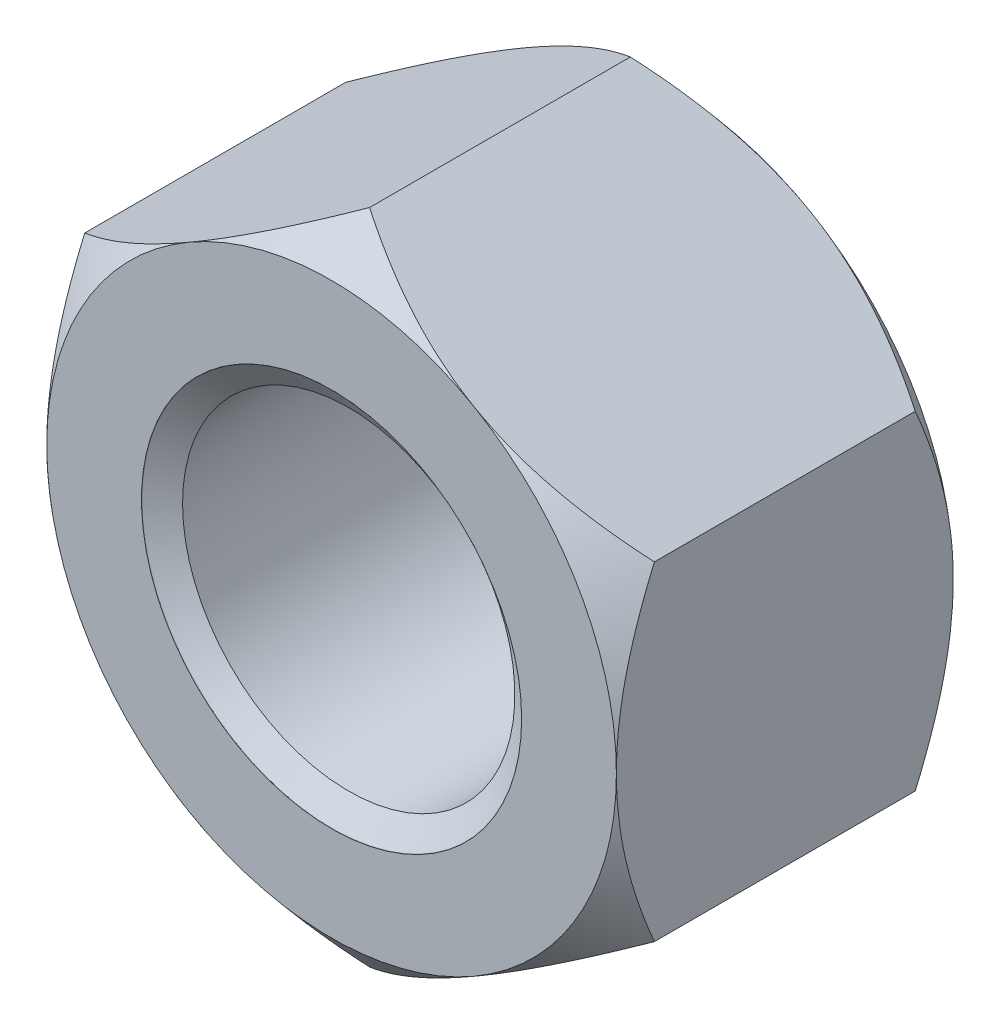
ISO-10303-21;
HEADER;
FILE_DESCRIPTION(('STEP AP214'),'2;1');
FILE_NAME('part.step','',(''),(''),'','','');
FILE_SCHEMA(('AUTOMOTIVE_DESIGN { 1 0 10303 214 1 1 1 1 }'));
ENDSEC;
DATA;
#1=APPLICATION_CONTEXT('core data for automotive mechanical design processes');
#2=APPLICATION_PROTOCOL_DEFINITION('international standard','automotive_design',2000,#1);
#3=PRODUCT_CONTEXT('',#1,'mechanical');
#4=PRODUCT('Part','Part','',(#3));
#5=PRODUCT_RELATED_PRODUCT_CATEGORY('part','',(#4));
#6=PRODUCT_DEFINITION_FORMATION('','',#4);
#7=PRODUCT_DEFINITION_CONTEXT('part definition',#1,'design');
#8=PRODUCT_DEFINITION('design','',#6,#7);
#9=PRODUCT_DEFINITION_SHAPE('','',#8);
#10=(LENGTH_UNIT() NAMED_UNIT(*) SI_UNIT(.MILLI.,.METRE.));
#11=(NAMED_UNIT(*) PLANE_ANGLE_UNIT() SI_UNIT($,.RADIAN.));
#12=(NAMED_UNIT(*) SI_UNIT($,.STERADIAN.) SOLID_ANGLE_UNIT());
#13=UNCERTAINTY_MEASURE_WITH_UNIT(LENGTH_MEASURE(1.E-05),#10,'distance_accuracy_value','');
#14=(GEOMETRIC_REPRESENTATION_CONTEXT(3) GLOBAL_UNCERTAINTY_ASSIGNED_CONTEXT((#13)) GLOBAL_UNIT_ASSIGNED_CONTEXT((#10,
#11,#12)) REPRESENTATION_CONTEXT('',''));
#15=CARTESIAN_POINT('',(0.,0.,0.));
#16=DIRECTION('',(0.,0.,1.));
#17=DIRECTION('',(1.,0.,0.));
#18=AXIS2_PLACEMENT_3D('',#15,#16,#17);
#19=CARTESIAN_POINT('',(0.,0.,-22.5298));
#20=DIRECTION('',(0.,0.,1.));
#21=DIRECTION('',(1.,0.,0.));
#22=AXIS2_PLACEMENT_3D('',#19,#20,#21);
#23=CYLINDRICAL_SURFACE('',#22,11.1125);
#24=CARTESIAN_POINT('',(0.,0.,-1.14587210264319));
#25=DIRECTION('',(0.,0.,-1.));
#26=DIRECTION('',(-1.,0.,0.));
#27=AXIS2_PLACEMENT_3D('',#24,#25,#26);
#28=CIRCLE('',#27,11.1125);
#29=CARTESIAN_POINT('',(-11.1125,0.,-1.14587210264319));
#30=VERTEX_POINT('',#29);
#31=EDGE_CURVE('E314',#30,#30,#28,.T.);
#32=ORIENTED_EDGE('',*,*,#31,.F.);
#33=EDGE_LOOP('',(#32));
#34=FACE_BOUND('',#33,.T.);
#35=CARTESIAN_POINT('',(0.,0.,-21.3839278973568));
#36=DIRECTION('',(0.,0.,-1.));
#37=DIRECTION('',(-1.,0.,0.));
#38=AXIS2_PLACEMENT_3D('',#35,#36,#37);
#39=CIRCLE('',#38,11.1125);
#40=CARTESIAN_POINT('',(-11.1125,0.,-21.3839278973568));
#41=VERTEX_POINT('',#40);
#42=EDGE_CURVE('E175',#41,#41,#39,.F.);
#43=ORIENTED_EDGE('',*,*,#42,.F.);
#44=EDGE_LOOP('',(#43));
#45=FACE_BOUND('',#44,.T.);
#46=ADVANCED_FACE('F32',(#34,#45),#23,.F.);
#47=CARTESIAN_POINT('',(-38.1,0.,-22.5298));
#48=DIRECTION('',(0.,0.,1.));
#49=DIRECTION('',(1.,0.,0.));
#50=AXIS2_PLACEMENT_3D('',#47,#48,#49);
#51=PLANE('',#50);
#52=CARTESIAN_POINT('',(0.,0.,-22.5298));
#53=DIRECTION('',(0.,0.,1.));
#54=DIRECTION('',(1.,0.,0.));
#55=AXIS2_PLACEMENT_3D('',#52,#53,#54);
#56=CIRCLE('',#55,19.05);
#57=CARTESIAN_POINT('',(19.05,0.,-22.5298));
#58=VERTEX_POINT('',#57);
#59=CARTESIAN_POINT('',(9.52500000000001,16.4977839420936,-22.5298));
#60=VERTEX_POINT('',#59);
#61=EDGE_CURVE('E248',#58,#60,#56,.T.);
#62=ORIENTED_EDGE('',*,*,#61,.F.);
#63=CARTESIAN_POINT('',(0.,0.,-22.5298));
#64=DIRECTION('',(0.,0.,1.));
#65=DIRECTION('',(1.,0.,0.));
#66=AXIS2_PLACEMENT_3D('',#63,#64,#65);
#67=CIRCLE('',#66,19.05);
#68=CARTESIAN_POINT('',(9.52500000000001,-16.4977839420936,-22.5298));
#69=VERTEX_POINT('',#68);
#70=EDGE_CURVE('E167',#58,#69,#67,.F.);
#71=ORIENTED_EDGE('',*,*,#70,.T.);
#72=CARTESIAN_POINT('',(-9.52500000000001,-16.4977839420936,-22.5298));
#73=VERTEX_POINT('',#72);
#74=EDGE_CURVE('E169',#69,#73,#67,.F.);
#75=ORIENTED_EDGE('',*,*,#74,.T.);
#76=CARTESIAN_POINT('',(-19.05,0.,-22.5298));
#77=VERTEX_POINT('',#76);
#78=EDGE_CURVE('E560',#73,#77,#67,.F.);
#79=ORIENTED_EDGE('',*,*,#78,.T.);
#80=CARTESIAN_POINT('',(-9.52500000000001,16.4977839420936,-22.5298));
#81=VERTEX_POINT('',#80);
#82=EDGE_CURVE('E558',#77,#81,#67,.F.);
#83=ORIENTED_EDGE('',*,*,#82,.T.);
#84=EDGE_CURVE('E151',#81,#60,#67,.F.);
#85=ORIENTED_EDGE('',*,*,#84,.T.);
#86=EDGE_LOOP('',(#62,#71,#75,#79,#83,#85));
#87=FACE_BOUND('',#86,.T.);
#88=CARTESIAN_POINT('',(0.,0.,-22.5298));
#89=DIRECTION('',(0.,0.,1.));
#90=DIRECTION('',(1.,0.,0.));
#91=AXIS2_PLACEMENT_3D('',#88,#89,#90);
#92=CIRCLE('',#91,12.7127);
#93=CARTESIAN_POINT('',(12.7127,0.,-22.5298));
#94=VERTEX_POINT('',#93);
#95=EDGE_CURVE('E173',#94,#94,#92,.F.);
#96=ORIENTED_EDGE('',*,*,#95,.F.);
#97=EDGE_LOOP('',(#96));
#98=FACE_BOUND('',#97,.T.);
#99=ADVANCED_FACE('F305',(#87,#98),#51,.F.);
#100=CARTESIAN_POINT('',(-38.1,0.,0.));
#101=DIRECTION('',(0.,0.,1.));
#102=DIRECTION('',(1.,0.,0.));
#103=AXIS2_PLACEMENT_3D('',#100,#101,#102);
#104=PLANE('',#103);
#105=CARTESIAN_POINT('',(0.,0.,0.));
#106=DIRECTION('',(0.,0.,1.));
#107=DIRECTION('',(1.,0.,0.));
#108=AXIS2_PLACEMENT_3D('',#105,#106,#107);
#109=CIRCLE('',#108,19.05);
#110=CARTESIAN_POINT('',(9.52500000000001,-16.4977839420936,0.));
#111=VERTEX_POINT('',#110);
#112=CARTESIAN_POINT('',(19.05,0.,0.));
#113=VERTEX_POINT('',#112);
#114=EDGE_CURVE('E44',#111,#113,#109,.T.);
#115=ORIENTED_EDGE('',*,*,#114,.T.);
#116=CARTESIAN_POINT('',(0.,0.,0.));
#117=DIRECTION('',(0.,0.,1.));
#118=DIRECTION('',(1.,0.,0.));
#119=AXIS2_PLACEMENT_3D('',#116,#117,#118);
#120=CIRCLE('',#119,19.05);
#121=CARTESIAN_POINT('',(9.52500000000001,16.4977839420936,0.));
#122=VERTEX_POINT('',#121);
#123=EDGE_CURVE('E51',#113,#122,#120,.T.);
#124=ORIENTED_EDGE('',*,*,#123,.T.);
#125=CARTESIAN_POINT('',(-9.52500000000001,16.4977839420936,0.));
#126=VERTEX_POINT('',#125);
#127=EDGE_CURVE('E11',#122,#126,#109,.T.);
#128=ORIENTED_EDGE('',*,*,#127,.T.);
#129=CARTESIAN_POINT('',(-19.05,0.,0.));
#130=VERTEX_POINT('',#129);
#131=EDGE_CURVE('E42',#126,#130,#109,.T.);
#132=ORIENTED_EDGE('',*,*,#131,.T.);
#133=CARTESIAN_POINT('',(-9.52500000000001,-16.4977839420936,0.));
#134=VERTEX_POINT('',#133);
#135=EDGE_CURVE('E537',#130,#134,#109,.T.);
#136=ORIENTED_EDGE('',*,*,#135,.T.);
#137=EDGE_CURVE('E172',#134,#111,#109,.T.);
#138=ORIENTED_EDGE('',*,*,#137,.T.);
#139=EDGE_LOOP('',(#115,#124,#128,#132,#136,#138));
#140=FACE_BOUND('',#139,.T.);
#141=CARTESIAN_POINT('',(0.,0.,0.));
#142=DIRECTION('',(0.,0.,1.));
#143=DIRECTION('',(1.,0.,0.));
#144=AXIS2_PLACEMENT_3D('',#141,#142,#143);
#145=CIRCLE('',#144,12.7127);
#146=CARTESIAN_POINT('',(12.7127,0.,0.));
#147=VERTEX_POINT('',#146);
#148=EDGE_CURVE('E178',#147,#147,#145,.T.);
#149=ORIENTED_EDGE('',*,*,#148,.F.);
#150=EDGE_LOOP('',(#149));
#151=FACE_BOUND('',#150,.T.);
#152=ADVANCED_FACE('F253',(#140,#151),#104,.T.);
#153=CARTESIAN_POINT('',(0.,21.9970452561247,-22.5298));
#154=DIRECTION('',(-0.5,0.866025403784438,0.));
#155=DIRECTION('',(-0.866025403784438,-0.5,0.));
#156=AXIS2_PLACEMENT_3D('',#153,#154,#155);
#157=PLANE('',#156);
#158=DIRECTION('',(0.,0.,1.));
#159=VECTOR('',#158,1.);
#160=CARTESIAN_POINT('',(-19.05,10.9985226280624,-22.5298));
#161=LINE('',#160,#159);
#162=CARTESIAN_POINT('',(-19.05,10.9985226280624,-19.98726));
#163=VERTEX_POINT('',#162);
#164=CARTESIAN_POINT('',(-19.05,10.9985226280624,-2.54253999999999));
#165=VERTEX_POINT('',#164);
#166=EDGE_CURVE('E163',#163,#165,#161,.T.);
#167=ORIENTED_EDGE('',*,*,#166,.T.);
#168=CARTESIAN_POINT('',(-19.0502,10.9984071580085,-2.54263962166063));
#169=CARTESIAN_POINT('',(-18.6769988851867,11.2138749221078,-2.35677556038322));
#170=CARTESIAN_POINT('',(-18.3011689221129,11.430860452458,-2.17773246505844));
#171=CARTESIAN_POINT('',(-17.5438933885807,11.8680736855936,-1.83549473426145));
#172=CARTESIAN_POINT('',(-17.1624446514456,12.0883032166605,-1.67230946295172));
#173=CARTESIAN_POINT('',(-16.3920595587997,12.5330852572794,-1.36343494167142));
#174=CARTESIAN_POINT('',(-16.0030950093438,12.757654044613,-1.21783878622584));
#175=CARTESIAN_POINT('',(-15.2197502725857,13.2099183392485,-0.947737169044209));
#176=CARTESIAN_POINT('',(-14.8253710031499,13.4376133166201,-0.823228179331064));
#177=CARTESIAN_POINT('',(-14.0386334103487,13.8918364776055,-0.599938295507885));
#178=CARTESIAN_POINT('',(-13.6463651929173,14.118312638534,-0.50073690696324));
#179=CARTESIAN_POINT('',(-12.8576236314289,14.5736927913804,-0.327594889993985));
#180=CARTESIAN_POINT('',(-12.4611501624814,14.8025968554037,-0.253655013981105));
#181=CARTESIAN_POINT('',(-11.6659562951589,15.2617022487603,-0.133200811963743));
#182=CARTESIAN_POINT('',(-11.2672427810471,15.4918996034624,-0.0866263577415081));
#183=CARTESIAN_POINT('',(-10.4680887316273,15.9532914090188,-0.0220520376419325));
#184=CARTESIAN_POINT('',(-10.067648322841,16.184485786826,-0.00405011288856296));
#185=CARTESIAN_POINT('',(-9.32247129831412,16.6147139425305,0.00235051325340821));
#186=CARTESIAN_POINT('',(-8.97775518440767,16.8137358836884,-0.00547211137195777));
#187=CARTESIAN_POINT('',(-8.28919614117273,17.2112756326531,-0.0424873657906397));
#188=CARTESIAN_POINT('',(-7.94535318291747,17.4097934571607,-0.0716792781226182));
#189=CARTESIAN_POINT('',(-7.25921734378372,17.8059341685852,-0.150798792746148));
#190=CARTESIAN_POINT('',(-6.91692579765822,18.0035562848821,-0.200741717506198));
#191=CARTESIAN_POINT('',(-6.23493995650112,18.3973009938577,-0.320291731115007));
#192=CARTESIAN_POINT('',(-5.89524569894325,18.5934235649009,-0.389899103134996));
#193=CARTESIAN_POINT('',(-5.21901607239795,18.9838449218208,-0.547427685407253));
#194=CARTESIAN_POINT('',(-4.88248119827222,19.178143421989,-0.635351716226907));
#195=CARTESIAN_POINT('',(-4.21301661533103,19.564658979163,-0.82798030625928));
#196=CARTESIAN_POINT('',(-3.88008745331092,19.7568757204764,-0.932687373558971));
#197=CARTESIAN_POINT('',(-2.8874441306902,20.3299786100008,-1.26946923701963));
#198=CARTESIAN_POINT('',(-2.23344452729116,20.7075654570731,-1.52430860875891));
#199=CARTESIAN_POINT('',(-1.319895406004,21.2350032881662,-1.91887667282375));
#200=CARTESIAN_POINT('',(-1.05363015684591,21.3887316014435,-2.03862284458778));
#201=CARTESIAN_POINT('',(-0.524434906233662,21.6942626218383,-2.28534183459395));
#202=CARTESIAN_POINT('',(-0.261497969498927,21.846069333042,-2.41229479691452));
#203=CARTESIAN_POINT('',(0.000200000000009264,21.9971607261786,-2.54263962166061));
#204=B_SPLINE_CURVE_WITH_KNOTS('',3,(#168,#169,#170,#171,#172,#173,#174,#175,#176,#177,#178,
#179,#180,#181,#182,#183,#184,#185,#186,#187,#188,#189,#190,#191,#192,#193,#194,#195,#196,#197,
#198,#199,#200,#201,#202,#203),.UNSPECIFIED.,.F.,.F.,(4,2,2,2,2,2,2,2,2,2,2,2,2,2,2,2,2,4),(0.,
1.40799576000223,2.81681796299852,4.23279724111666,5.64853938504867,7.03894936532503,
8.42940075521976,9.81678546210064,11.2040701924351,12.3978655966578,13.5916209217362,
14.7862592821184,15.9809148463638,17.1757545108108,18.3707729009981,20.7592937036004,
21.7490974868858,22.7362953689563),.UNSPECIFIED.);
#205=EDGE_CURVE('E59',#165,#126,#204,.T.);
#206=ORIENTED_EDGE('',*,*,#205,.T.);
#207=CARTESIAN_POINT('',(0.,21.9970452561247,-2.54254));
#208=VERTEX_POINT('',#207);
#209=EDGE_CURVE('E241',#126,#208,#204,.T.);
#210=ORIENTED_EDGE('',*,*,#209,.T.);
#211=DIRECTION('',(0.,0.,1.));
#212=VECTOR('',#211,1.);
#213=CARTESIAN_POINT('',(0.,21.9970452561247,-22.5298));
#214=LINE('',#213,#212);
#215=CARTESIAN_POINT('',(0.,21.9970452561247,-19.98726));
#216=VERTEX_POINT('',#215);
#217=EDGE_CURVE('E148',#216,#208,#214,.T.);
#218=ORIENTED_EDGE('',*,*,#217,.F.);
#219=CARTESIAN_POINT('',(-19.0502,10.9984071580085,-19.9871603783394));
#220=CARTESIAN_POINT('',(-18.6769988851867,11.2138749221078,-20.1730244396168));
#221=CARTESIAN_POINT('',(-18.3011689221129,11.430860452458,-20.3520675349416));
#222=CARTESIAN_POINT('',(-17.5438933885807,11.8680736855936,-20.6943052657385));
#223=CARTESIAN_POINT('',(-17.1624446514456,12.0883032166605,-20.8574905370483));
#224=CARTESIAN_POINT('',(-16.3920595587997,12.5330852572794,-21.1663650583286));
#225=CARTESIAN_POINT('',(-16.0030950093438,12.757654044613,-21.3119612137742));
#226=CARTESIAN_POINT('',(-15.2197502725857,13.2099183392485,-21.5820628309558));
#227=CARTESIAN_POINT('',(-14.8253710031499,13.4376133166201,-21.7065718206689));
#228=CARTESIAN_POINT('',(-14.0386334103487,13.8918364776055,-21.9298617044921));
#229=CARTESIAN_POINT('',(-13.6463651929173,14.118312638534,-22.0290630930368));
#230=CARTESIAN_POINT('',(-12.8576236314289,14.5736927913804,-22.202205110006));
#231=CARTESIAN_POINT('',(-12.4611501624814,14.8025968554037,-22.2761449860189));
#232=CARTESIAN_POINT('',(-11.6659562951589,15.2617022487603,-22.3965991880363));
#233=CARTESIAN_POINT('',(-11.2672427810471,15.4918996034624,-22.4431736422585));
#234=CARTESIAN_POINT('',(-10.4680887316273,15.9532914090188,-22.5077479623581));
#235=CARTESIAN_POINT('',(-10.067648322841,16.184485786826,-22.5257498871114));
#236=CARTESIAN_POINT('',(-9.32247129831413,16.6147139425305,-22.5321505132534));
#237=CARTESIAN_POINT('',(-8.97775518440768,16.8137358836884,-22.524327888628));
#238=CARTESIAN_POINT('',(-8.28919614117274,17.2112756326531,-22.4873126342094));
#239=CARTESIAN_POINT('',(-7.94535318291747,17.4097934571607,-22.4581207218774));
#240=CARTESIAN_POINT('',(-7.25921734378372,17.8059341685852,-22.3790012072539));
#241=CARTESIAN_POINT('',(-6.91692579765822,18.0035562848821,-22.3290582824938));
#242=CARTESIAN_POINT('',(-6.23493995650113,18.3973009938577,-22.209508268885));
#243=CARTESIAN_POINT('',(-5.89524569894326,18.5934235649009,-22.139900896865));
#244=CARTESIAN_POINT('',(-5.21901607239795,18.9838449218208,-21.9823723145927));
#245=CARTESIAN_POINT('',(-4.88248119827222,19.178143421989,-21.8944482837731));
#246=CARTESIAN_POINT('',(-4.21301661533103,19.564658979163,-21.7018196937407));
#247=CARTESIAN_POINT('',(-3.88008745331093,19.7568757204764,-21.597112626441));
#248=CARTESIAN_POINT('',(-2.8874441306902,20.3299786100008,-21.2603307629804));
#249=CARTESIAN_POINT('',(-2.23344452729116,20.7075654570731,-21.0054913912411));
#250=CARTESIAN_POINT('',(-1.31989540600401,21.2350032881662,-20.6109233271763));
#251=CARTESIAN_POINT('',(-1.05363015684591,21.3887316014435,-20.4911771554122));
#252=CARTESIAN_POINT('',(-0.524434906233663,21.6942626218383,-20.2444581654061));
#253=CARTESIAN_POINT('',(-0.261497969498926,21.846069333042,-20.1175052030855));
#254=CARTESIAN_POINT('',(0.000200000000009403,21.9971607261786,-19.9871603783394));
#255=B_SPLINE_CURVE_WITH_KNOTS('',3,(#219,#220,#221,#222,#223,#224,#225,#226,#227,#228,#229,
#230,#231,#232,#233,#234,#235,#236,#237,#238,#239,#240,#241,#242,#243,#244,#245,#246,#247,#248,
#249,#250,#251,#252,#253,#254),.UNSPECIFIED.,.F.,.F.,(4,2,2,2,2,2,2,2,2,2,2,2,2,2,2,2,2,4),(0.,
1.40799576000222,2.81681796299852,4.23279724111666,5.64853938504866,7.03894936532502,
8.42940075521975,9.81678546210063,11.2040701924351,12.3978655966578,13.5916209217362,
14.7862592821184,15.9809148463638,17.1757545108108,18.3707729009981,20.7592937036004,
21.7490974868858,22.7362953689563),.UNSPECIFIED.);
#256=EDGE_CURVE('E166',#81,#216,#255,.T.);
#257=ORIENTED_EDGE('',*,*,#256,.F.);
#258=EDGE_CURVE('E264',#163,#81,#255,.T.);
#259=ORIENTED_EDGE('',*,*,#258,.F.);
#260=EDGE_LOOP('',(#167,#206,#210,#218,#257,#259));
#261=FACE_BOUND('',#260,.T.);
#262=ADVANCED_FACE('F34',(#261),#157,.T.);
#263=CARTESIAN_POINT('',(19.05,10.9985226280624,-22.5298));
#264=DIRECTION('',(0.5,0.866025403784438,0.));
#265=DIRECTION('',(-0.866025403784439,0.5,0.));
#266=AXIS2_PLACEMENT_3D('',#263,#264,#265);
#267=PLANE('',#266);
#268=ORIENTED_EDGE('',*,*,#217,.T.);
#269=CARTESIAN_POINT('',(-0.000200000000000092,21.9971607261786,-2.54263962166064));
#270=CARTESIAN_POINT('',(0.37300111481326,21.7816929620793,-2.35677556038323));
#271=CARTESIAN_POINT('',(0.748831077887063,21.5647074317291,-2.17773246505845));
#272=CARTESIAN_POINT('',(1.50610661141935,21.1274941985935,-1.83549473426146));
#273=CARTESIAN_POINT('',(1.88755534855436,20.9072646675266,-1.67230946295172));
#274=CARTESIAN_POINT('',(2.65794044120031,20.4624826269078,-1.36343494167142));
#275=CARTESIAN_POINT('',(3.04690499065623,20.2379138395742,-1.21783878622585));
#276=CARTESIAN_POINT('',(3.83024972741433,19.7856495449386,-0.947737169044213));
#277=CARTESIAN_POINT('',(4.22462899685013,19.557954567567,-0.823228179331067));
#278=CARTESIAN_POINT('',(5.01136658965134,19.1037314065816,-0.599938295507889));
#279=CARTESIAN_POINT('',(5.40363480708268,18.8772552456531,-0.500736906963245));
#280=CARTESIAN_POINT('',(6.19237636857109,18.4218750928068,-0.32759488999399));
#281=CARTESIAN_POINT('',(6.58884983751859,18.1929710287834,-0.253655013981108));
#282=CARTESIAN_POINT('',(7.3840437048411,17.7338656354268,-0.133200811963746));
#283=CARTESIAN_POINT('',(7.78275721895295,17.5036682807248,-0.0866263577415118));
#284=CARTESIAN_POINT('',(8.58191126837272,17.0422764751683,-0.0220520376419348));
#285=CARTESIAN_POINT('',(8.98235167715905,16.8110820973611,-0.00405011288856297));
#286=CARTESIAN_POINT('',(9.72752870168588,16.3808539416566,0.0023505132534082));
#287=CARTESIAN_POINT('',(10.0722448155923,16.1818320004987,-0.00547211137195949));
#288=CARTESIAN_POINT('',(10.7608038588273,15.7842922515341,-0.0424873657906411));
#289=CARTESIAN_POINT('',(11.1046468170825,15.5857744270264,-0.0716792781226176));
#290=CARTESIAN_POINT('',(11.7907826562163,15.1896337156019,-0.150798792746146));
#291=CARTESIAN_POINT('',(12.1330742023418,14.992011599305,-0.200741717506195));
#292=CARTESIAN_POINT('',(12.8150600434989,14.5982668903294,-0.320291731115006));
#293=CARTESIAN_POINT('',(13.1547543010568,14.4021443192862,-0.389899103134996));
#294=CARTESIAN_POINT('',(13.8309839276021,14.0117229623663,-0.547427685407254));
#295=CARTESIAN_POINT('',(14.1675188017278,13.8174244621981,-0.635351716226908));
#296=CARTESIAN_POINT('',(14.836983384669,13.4309089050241,-0.82798030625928));
#297=CARTESIAN_POINT('',(15.1699125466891,13.2386921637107,-0.93268737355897));
#298=CARTESIAN_POINT('',(16.1625558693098,12.6655892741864,-1.26946923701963));
#299=CARTESIAN_POINT('',(16.8165554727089,12.288002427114,-1.52430860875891));
#300=CARTESIAN_POINT('',(17.730104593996,11.7605645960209,-1.91887667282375));
#301=CARTESIAN_POINT('',(17.9963698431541,11.6068362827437,-2.03862284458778));
#302=CARTESIAN_POINT('',(18.5255650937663,11.3013052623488,-2.28534183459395));
#303=CARTESIAN_POINT('',(18.7885020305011,11.1494985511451,-2.41229479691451));
#304=CARTESIAN_POINT('',(19.0502,10.9984071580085,-2.5426396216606));
#305=B_SPLINE_CURVE_WITH_KNOTS('',3,(#269,#270,#271,#272,#273,#274,#275,#276,#277,#278,#279,
#280,#281,#282,#283,#284,#285,#286,#287,#288,#289,#290,#291,#292,#293,#294,#295,#296,#297,#298,
#299,#300,#301,#302,#303,#304),.UNSPECIFIED.,.F.,.F.,(4,2,2,2,2,2,2,2,2,2,2,2,2,2,2,2,2,4),(0.,
1.40799576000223,2.81681796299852,4.23279724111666,5.64853938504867,7.03894936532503,
8.42940075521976,9.81678546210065,11.2040701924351,12.3978655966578,13.5916209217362,
14.7862592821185,15.9809148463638,17.1757545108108,18.3707729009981,20.7592937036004,
21.7490974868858,22.7362953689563),.UNSPECIFIED.);
#306=EDGE_CURVE('E141',#208,#122,#305,.T.);
#307=ORIENTED_EDGE('',*,*,#306,.T.);
#308=CARTESIAN_POINT('',(19.05,10.9985226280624,-2.54254));
#309=VERTEX_POINT('',#308);
#310=EDGE_CURVE('E127',#122,#309,#305,.T.);
#311=ORIENTED_EDGE('',*,*,#310,.T.);
#312=DIRECTION('',(0.,0.,1.));
#313=VECTOR('',#312,1.);
#314=CARTESIAN_POINT('',(19.05,10.9985226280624,-22.5298));
#315=LINE('',#314,#313);
#316=CARTESIAN_POINT('',(19.05,10.9985226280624,-19.98726));
#317=VERTEX_POINT('',#316);
#318=EDGE_CURVE('E140',#317,#309,#315,.T.);
#319=ORIENTED_EDGE('',*,*,#318,.F.);
#320=CARTESIAN_POINT('',(-0.000200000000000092,21.9971607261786,-19.9871603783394));
#321=CARTESIAN_POINT('',(0.37300111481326,21.7816929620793,-20.1730244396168));
#322=CARTESIAN_POINT('',(0.748831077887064,21.5647074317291,-20.3520675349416));
#323=CARTESIAN_POINT('',(1.50610661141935,21.1274941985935,-20.6943052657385));
#324=CARTESIAN_POINT('',(1.88755534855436,20.9072646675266,-20.8574905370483));
#325=CARTESIAN_POINT('',(2.65794044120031,20.4624826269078,-21.1663650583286));
#326=CARTESIAN_POINT('',(3.04690499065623,20.2379138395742,-21.3119612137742));
#327=CARTESIAN_POINT('',(3.83024972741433,19.7856495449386,-21.5820628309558));
#328=CARTESIAN_POINT('',(4.22462899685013,19.557954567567,-21.7065718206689));
#329=CARTESIAN_POINT('',(5.01136658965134,19.1037314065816,-21.9298617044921));
#330=CARTESIAN_POINT('',(5.40363480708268,18.8772552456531,-22.0290630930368));
#331=CARTESIAN_POINT('',(6.19237636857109,18.4218750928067,-22.202205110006));
#332=CARTESIAN_POINT('',(6.58884983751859,18.1929710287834,-22.2761449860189));
#333=CARTESIAN_POINT('',(7.3840437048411,17.7338656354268,-22.3965991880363));
#334=CARTESIAN_POINT('',(7.78275721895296,17.5036682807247,-22.4431736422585));
#335=CARTESIAN_POINT('',(8.58191126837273,17.0422764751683,-22.5077479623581));
#336=CARTESIAN_POINT('',(8.98235167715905,16.8110820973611,-22.5257498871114));
#337=CARTESIAN_POINT('',(9.72752870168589,16.3808539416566,-22.5321505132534));
#338=CARTESIAN_POINT('',(10.0722448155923,16.1818320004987,-22.524327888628));
#339=CARTESIAN_POINT('',(10.7608038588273,15.784292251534,-22.4873126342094));
#340=CARTESIAN_POINT('',(11.1046468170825,15.5857744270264,-22.4581207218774));
#341=CARTESIAN_POINT('',(11.7907826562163,15.1896337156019,-22.3790012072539));
#342=CARTESIAN_POINT('',(12.1330742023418,14.992011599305,-22.3290582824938));
#343=CARTESIAN_POINT('',(12.8150600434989,14.5982668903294,-22.209508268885));
#344=CARTESIAN_POINT('',(13.1547543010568,14.4021443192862,-22.139900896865));
#345=CARTESIAN_POINT('',(13.8309839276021,14.0117229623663,-21.9823723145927));
#346=CARTESIAN_POINT('',(14.1675188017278,13.8174244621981,-21.8944482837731));
#347=CARTESIAN_POINT('',(14.836983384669,13.4309089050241,-21.7018196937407));
#348=CARTESIAN_POINT('',(15.1699125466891,13.2386921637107,-21.597112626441));
#349=CARTESIAN_POINT('',(16.1625558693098,12.6655892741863,-21.2603307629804));
#350=CARTESIAN_POINT('',(16.8165554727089,12.288002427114,-21.0054913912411));
#351=CARTESIAN_POINT('',(17.730104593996,11.7605645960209,-20.6109233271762));
#352=CARTESIAN_POINT('',(17.9963698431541,11.6068362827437,-20.4911771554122));
#353=CARTESIAN_POINT('',(18.5255650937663,11.3013052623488,-20.2444581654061));
#354=CARTESIAN_POINT('',(18.7885020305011,11.1494985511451,-20.1175052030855));
#355=CARTESIAN_POINT('',(19.0502,10.9984071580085,-19.9871603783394));
#356=B_SPLINE_CURVE_WITH_KNOTS('',3,(#320,#321,#322,#323,#324,#325,#326,#327,#328,#329,#330,
#331,#332,#333,#334,#335,#336,#337,#338,#339,#340,#341,#342,#343,#344,#345,#346,#347,#348,#349,
#350,#351,#352,#353,#354,#355),.UNSPECIFIED.,.F.,.F.,(4,2,2,2,2,2,2,2,2,2,2,2,2,2,2,2,2,4),(0.,
1.40799576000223,2.81681796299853,4.23279724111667,5.64853938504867,7.03894936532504,
8.42940075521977,9.81678546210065,11.2040701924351,12.3978655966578,13.5916209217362,
14.7862592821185,15.9809148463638,17.1757545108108,18.3707729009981,20.7592937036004,
21.7490974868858,22.7362953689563),.UNSPECIFIED.);
#357=EDGE_CURVE('E257',#60,#317,#356,.T.);
#358=ORIENTED_EDGE('',*,*,#357,.F.);
#359=EDGE_CURVE('E263',#216,#60,#356,.T.);
#360=ORIENTED_EDGE('',*,*,#359,.F.);
#361=EDGE_LOOP('',(#268,#307,#311,#319,#358,#360));
#362=FACE_BOUND('',#361,.T.);
#363=ADVANCED_FACE('F138',(#362),#267,.T.);
#364=CARTESIAN_POINT('',(19.05,10.9985226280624,-22.5298));
#365=DIRECTION('',(-1.,0.,0.));
#366=DIRECTION('',(0.,0.,1.));
#367=AXIS2_PLACEMENT_3D('',#364,#365,#366);
#368=PLANE('',#367);
#369=CARTESIAN_POINT('',(19.05,-24.3355008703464,-10.2278086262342));
#370=CARTESIAN_POINT('',(19.05,-24.0277736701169,-10.0187583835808));
#371=CARTESIAN_POINT('',(19.05,-23.7193502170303,-9.81073375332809));
#372=CARTESIAN_POINT('',(19.05,-23.1009881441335,-9.3969388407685));
#373=CARTESIAN_POINT('',(19.05,-22.7910495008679,-9.19116859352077));
#374=CARTESIAN_POINT('',(19.05,-21.8586628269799,-8.57746935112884));
#375=CARTESIAN_POINT('',(19.05,-21.2337710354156,-8.17323835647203));
#376=CARTESIAN_POINT('',(19.05,-19.9719471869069,-7.37388770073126));
#377=CARTESIAN_POINT('',(19.05,-19.3349611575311,-6.9788530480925));
#378=CARTESIAN_POINT('',(19.05,-18.0520423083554,-6.20363305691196));
#379=CARTESIAN_POINT('',(19.05,-17.4061100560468,-5.82344678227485));
#380=CARTESIAN_POINT('',(19.05,-16.0683891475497,-5.06123679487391));
#381=CARTESIAN_POINT('',(19.05,-15.3760153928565,-4.68023490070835));
#382=CARTESIAN_POINT('',(19.05,-13.9775382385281,-3.9438776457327));
#383=CARTESIAN_POINT('',(19.05,-13.271432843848,-3.5885260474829));
#384=CARTESIAN_POINT('',(19.05,-11.8455249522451,-2.91146374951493));
#385=CARTESIAN_POINT('',(19.05,-11.1257649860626,-2.58966408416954));
#386=CARTESIAN_POINT('',(19.05,-9.66912101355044,-1.98761264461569));
#387=CARTESIAN_POINT('',(19.05,-8.93224422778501,-1.70734370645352));
#388=CARTESIAN_POINT('',(19.05,-7.82417600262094,-1.32991058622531));
#389=CARTESIAN_POINT('',(19.05,-7.45977313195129,-1.21269550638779));
#390=CARTESIAN_POINT('',(19.05,-6.72680592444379,-0.992034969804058));
#391=CARTESIAN_POINT('',(19.05,-6.35824171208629,-0.888589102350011));
#392=CARTESIAN_POINT('',(19.05,-5.61714416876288,-0.69687189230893));
#393=CARTESIAN_POINT('',(19.05,-5.2446105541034,-0.608601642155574));
#394=CARTESIAN_POINT('',(19.05,-4.49600717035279,-0.448630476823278));
#395=CARTESIAN_POINT('',(19.05,-4.11993762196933,-0.37692853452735));
#396=CARTESIAN_POINT('',(19.05,-3.37183984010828,-0.252515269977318));
#397=CARTESIAN_POINT('',(19.05,-2.99986645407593,-0.199475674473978));
#398=CARTESIAN_POINT('',(19.05,-2.25377026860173,-0.111550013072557));
#399=CARTESIAN_POINT('',(19.05,-1.87964748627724,-0.0766638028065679));
#400=CARTESIAN_POINT('',(19.05,-1.13014656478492,-0.0257417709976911));
#401=CARTESIAN_POINT('',(19.05,-0.754768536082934,-0.0097043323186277));
#402=CARTESIAN_POINT('',(19.05,-0.0036841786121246,0.00319194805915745));
#403=CARTESIAN_POINT('',(19.05,0.372022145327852,5.10672546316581E-05));
#404=CARTESIAN_POINT('',(19.05,1.09772922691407,-0.0244925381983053));
#405=CARTESIAN_POINT('',(19.05,1.44777250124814,-0.0446627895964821));
#406=CARTESIAN_POINT('',(19.05,2.14653011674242,-0.101283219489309));
#407=CARTESIAN_POINT('',(19.05,2.49524447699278,-0.137733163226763));
#408=CARTESIAN_POINT('',(19.05,3.19068381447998,-0.226291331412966));
#409=CARTESIAN_POINT('',(19.05,3.53740870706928,-0.278400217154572));
#410=CARTESIAN_POINT('',(19.05,4.22829608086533,-0.397442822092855));
#411=CARTESIAN_POINT('',(19.05,4.57245853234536,-0.464376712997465));
#412=CARTESIAN_POINT('',(19.05,5.26490320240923,-0.613624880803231));
#413=CARTESIAN_POINT('',(19.05,5.61312256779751,-0.696229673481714));
#414=CARTESIAN_POINT('',(19.05,6.30612366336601,-0.874739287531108));
#415=CARTESIAN_POINT('',(19.05,6.65090536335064,-0.970644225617));
#416=CARTESIAN_POINT('',(19.05,7.33675828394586,-1.17457198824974));
#417=CARTESIAN_POINT('',(19.05,7.6778304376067,-1.28259168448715));
#418=CARTESIAN_POINT('',(19.05,8.35626493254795,-1.5096311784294));
#419=CARTESIAN_POINT('',(19.05,8.6936273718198,-1.62865068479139));
#420=CARTESIAN_POINT('',(19.05,9.64129472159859,-1.97881852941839));
#421=CARTESIAN_POINT('',(19.05,10.2473470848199,-2.22152109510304));
#422=CARTESIAN_POINT('',(19.05,11.447938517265,-2.73406046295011));
#423=CARTESIAN_POINT('',(19.05,12.042474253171,-3.00390498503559));
#424=CARTESIAN_POINT('',(19.05,13.2215691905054,-3.56607107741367));
#425=CARTESIAN_POINT('',(19.05,13.8061167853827,-3.85841687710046));
#426=CARTESIAN_POINT('',(19.05,14.9656524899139,-4.46128215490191));
#427=CARTESIAN_POINT('',(19.05,15.5406414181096,-4.77180006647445));
#428=CARTESIAN_POINT('',(19.05,16.6856847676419,-5.40973312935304));
#429=CARTESIAN_POINT('',(19.05,17.255688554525,-5.73723884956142));
#430=CARTESIAN_POINT('',(19.05,18.3882895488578,-6.40480240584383));
#431=CARTESIAN_POINT('',(19.05,18.9508866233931,-6.74486046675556));
#432=CARTESIAN_POINT('',(19.05,20.0692988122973,-7.43524435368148));
#433=CARTESIAN_POINT('',(19.05,20.625117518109,-7.78556437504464));
#434=CARTESIAN_POINT('',(19.05,21.731110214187,-8.49497811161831));
#435=CARTESIAN_POINT('',(19.05,22.2812842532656,-8.85407175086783));
#436=CARTESIAN_POINT('',(19.05,23.3228056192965,-9.54398466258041));
#437=CARTESIAN_POINT('',(19.05,23.8146141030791,-9.87410893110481));
#438=CARTESIAN_POINT('',(19.05,24.7946769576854,-10.5395953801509));
#439=CARTESIAN_POINT('',(19.05,25.2829312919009,-10.8749576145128));
#440=CARTESIAN_POINT('',(19.05,26.7430916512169,-11.8879382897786));
#441=CARTESIAN_POINT('',(19.05,27.7102757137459,-12.5723711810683));
#442=CARTESIAN_POINT('',(19.05,29.1471424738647,-13.604916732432));
#443=CARTESIAN_POINT('',(19.05,29.6206388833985,-13.9477547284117));
#444=CARTESIAN_POINT('',(19.05,30.5654258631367,-14.6364623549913));
#445=CARTESIAN_POINT('',(19.05,31.0367164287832,-14.982331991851));
#446=CARTESIAN_POINT('',(19.05,31.9771886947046,-15.6766671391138));
#447=CARTESIAN_POINT('',(19.05,32.4463709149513,-16.0251319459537));
#448=CARTESIAN_POINT('',(19.05,33.3829333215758,-16.7244655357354));
#449=CARTESIAN_POINT('',(19.05,33.8503135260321,-17.0753342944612));
#450=CARTESIAN_POINT('',(19.05,34.3168887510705,-17.4272678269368));
#451=B_SPLINE_CURVE_WITH_KNOTS('',3,(#369,#370,#371,#372,#373,#374,#375,#376,#377,#378,#379,
#380,#381,#382,#383,#384,#385,#386,#387,#388,#389,#390,#391,#392,#393,#394,#395,#396,#397,#398,
#399,#400,#401,#402,#403,#404,#405,#406,#407,#408,#409,#410,#411,#412,#413,#414,#415,#416,#417,
#418,#419,#420,#421,#422,#423,#424,#425,#426,#427,#428,#429,#430,#431,#432,#433,#434,#435,#436,
#437,#438,#439,#440,#441,#442,#443,#444,#445,#446,#447,#448,#449,#450),.UNSPECIFIED.,.F.,.F.,(4,
2,2,2,2,2,2,2,2,2,2,2,2,2,2,2,2,2,2,2,2,2,2,2,2,2,2,2,2,2,2,2,2,2,2,2,2,2,2,2,4),(0.,
1.11605275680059,2.23212284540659,4.46472391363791,6.71316753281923,8.96146917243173,
11.3318886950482,13.7026552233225,16.0669664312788,18.4302977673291,19.578449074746,
20.7265661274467,21.8747657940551,23.0228942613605,24.1496778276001,25.2764524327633,
26.403130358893,27.5297919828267,28.5812790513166,29.6327509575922,30.684267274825,
31.7357957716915,32.8091595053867,33.8825326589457,34.9556292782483,36.0286974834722,
37.9863382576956,39.9445374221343,41.9048754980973,43.8650448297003,45.837029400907,
47.8090493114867,49.7799745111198,51.7508826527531,53.527841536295,55.3048186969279,
58.8592031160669,60.6129443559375,62.3666892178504,64.1199747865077,65.8732427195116),.UNSPECIFIED.);
#452=CARTESIAN_POINT('',(19.05,-10.9985226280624,-2.54254));
#453=VERTEX_POINT('',#452);
#454=EDGE_CURVE('E133',#453,#113,#451,.T.);
#455=ORIENTED_EDGE('',*,*,#454,.F.);
#456=DIRECTION('',(0.,0.,1.));
#457=VECTOR('',#456,1.);
#458=CARTESIAN_POINT('',(19.05,-10.9985226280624,-22.5298));
#459=LINE('',#458,#457);
#460=CARTESIAN_POINT('',(19.05,-10.9985226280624,-19.98726));
#461=VERTEX_POINT('',#460);
#462=EDGE_CURVE('E149',#461,#453,#459,.T.);
#463=ORIENTED_EDGE('',*,*,#462,.F.);
#464=CARTESIAN_POINT('',(19.05,-24.3355008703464,-12.3019913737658));
#465=CARTESIAN_POINT('',(19.05,-24.0277736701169,-12.5110416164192));
#466=CARTESIAN_POINT('',(19.05,-23.7193502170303,-12.7190662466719));
#467=CARTESIAN_POINT('',(19.05,-23.1009881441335,-13.1328611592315));
#468=CARTESIAN_POINT('',(19.05,-22.7910495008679,-13.3386314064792));
#469=CARTESIAN_POINT('',(19.05,-21.8586628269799,-13.9523306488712));
#470=CARTESIAN_POINT('',(19.05,-21.2337710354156,-14.356561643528));
#471=CARTESIAN_POINT('',(19.05,-19.9719471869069,-15.1559122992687));
#472=CARTESIAN_POINT('',(19.05,-19.3349611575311,-15.5509469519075));
#473=CARTESIAN_POINT('',(19.05,-18.0520423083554,-16.326166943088));
#474=CARTESIAN_POINT('',(19.05,-17.4061100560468,-16.7063532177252));
#475=CARTESIAN_POINT('',(19.05,-16.0683891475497,-17.4685632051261));
#476=CARTESIAN_POINT('',(19.05,-15.3760153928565,-17.8495650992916));
#477=CARTESIAN_POINT('',(19.05,-13.9775382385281,-18.5859223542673));
#478=CARTESIAN_POINT('',(19.05,-13.271432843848,-18.9412739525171));
#479=CARTESIAN_POINT('',(19.05,-11.8455249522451,-19.6183362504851));
#480=CARTESIAN_POINT('',(19.05,-11.1257649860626,-19.9401359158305));
#481=CARTESIAN_POINT('',(19.05,-9.66912101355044,-20.5421873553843));
#482=CARTESIAN_POINT('',(19.05,-8.93224422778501,-20.8224562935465));
#483=CARTESIAN_POINT('',(19.05,-7.82417600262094,-21.1998894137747));
#484=CARTESIAN_POINT('',(19.05,-7.45977313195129,-21.3171044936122));
#485=CARTESIAN_POINT('',(19.05,-6.7268059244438,-21.5377650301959));
#486=CARTESIAN_POINT('',(19.05,-6.35824171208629,-21.64121089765));
#487=CARTESIAN_POINT('',(19.05,-5.61714416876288,-21.8329281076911));
#488=CARTESIAN_POINT('',(19.05,-5.2446105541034,-21.9211983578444));
#489=CARTESIAN_POINT('',(19.05,-4.49600717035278,-22.0811695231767));
#490=CARTESIAN_POINT('',(19.05,-4.11993762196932,-22.1528714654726));
#491=CARTESIAN_POINT('',(19.05,-3.37183984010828,-22.2772847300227));
#492=CARTESIAN_POINT('',(19.05,-2.99986645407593,-22.330324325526));
#493=CARTESIAN_POINT('',(19.05,-2.25377026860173,-22.4182499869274));
#494=CARTESIAN_POINT('',(19.05,-1.87964748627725,-22.4531361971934));
#495=CARTESIAN_POINT('',(19.05,-1.13014656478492,-22.5040582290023));
#496=CARTESIAN_POINT('',(19.05,-0.754768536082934,-22.5200956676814));
#497=CARTESIAN_POINT('',(19.05,-0.00368417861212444,-22.5329919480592));
#498=CARTESIAN_POINT('',(19.05,0.372022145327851,-22.5298510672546));
#499=CARTESIAN_POINT('',(19.05,1.09772922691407,-22.5053074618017));
#500=CARTESIAN_POINT('',(19.05,1.44777250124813,-22.4851372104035));
#501=CARTESIAN_POINT('',(19.05,2.14653011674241,-22.4285167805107));
#502=CARTESIAN_POINT('',(19.05,2.49524447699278,-22.3920668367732));
#503=CARTESIAN_POINT('',(19.05,3.19068381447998,-22.303508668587));
#504=CARTESIAN_POINT('',(19.05,3.53740870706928,-22.2513997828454));
#505=CARTESIAN_POINT('',(19.05,4.22829608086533,-22.1323571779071));
#506=CARTESIAN_POINT('',(19.05,4.57245853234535,-22.0654232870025));
#507=CARTESIAN_POINT('',(19.05,5.26490320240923,-21.9161751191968));
#508=CARTESIAN_POINT('',(19.05,5.61312256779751,-21.8335703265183));
#509=CARTESIAN_POINT('',(19.05,6.306123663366,-21.6550607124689));
#510=CARTESIAN_POINT('',(19.05,6.65090536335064,-21.559155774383));
#511=CARTESIAN_POINT('',(19.05,7.33675828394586,-21.3552280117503));
#512=CARTESIAN_POINT('',(19.05,7.6778304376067,-21.2472083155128));
#513=CARTESIAN_POINT('',(19.05,8.35626493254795,-21.0201688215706));
#514=CARTESIAN_POINT('',(19.05,8.6936273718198,-20.9011493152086));
#515=CARTESIAN_POINT('',(19.05,9.64129472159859,-20.5509814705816));
#516=CARTESIAN_POINT('',(19.05,10.2473470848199,-20.308278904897));
#517=CARTESIAN_POINT('',(19.05,11.447938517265,-19.7957395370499));
#518=CARTESIAN_POINT('',(19.05,12.042474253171,-19.5258950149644));
#519=CARTESIAN_POINT('',(19.05,13.2215691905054,-18.9637289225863));
#520=CARTESIAN_POINT('',(19.05,13.8061167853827,-18.6713831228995));
#521=CARTESIAN_POINT('',(19.05,14.9656524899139,-18.0685178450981));
#522=CARTESIAN_POINT('',(19.05,15.5406414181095,-17.7579999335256));
#523=CARTESIAN_POINT('',(19.05,16.6856847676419,-17.120066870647));
#524=CARTESIAN_POINT('',(19.05,17.255688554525,-16.7925611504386));
#525=CARTESIAN_POINT('',(19.05,18.3882895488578,-16.1249975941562));
#526=CARTESIAN_POINT('',(19.05,18.9508866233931,-15.7849395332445));
#527=CARTESIAN_POINT('',(19.05,20.0692988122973,-15.0945556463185));
#528=CARTESIAN_POINT('',(19.05,20.625117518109,-14.7442356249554));
#529=CARTESIAN_POINT('',(19.05,21.731110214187,-14.0348218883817));
#530=CARTESIAN_POINT('',(19.05,22.2812842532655,-13.6757282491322));
#531=CARTESIAN_POINT('',(19.05,23.3228056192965,-12.9858153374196));
#532=CARTESIAN_POINT('',(19.05,23.814614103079,-12.6556910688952));
#533=CARTESIAN_POINT('',(19.05,24.7946769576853,-11.9902046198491));
#534=CARTESIAN_POINT('',(19.05,25.2829312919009,-11.6548423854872));
#535=CARTESIAN_POINT('',(19.05,26.7430916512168,-10.6418617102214));
#536=CARTESIAN_POINT('',(19.05,27.7102757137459,-9.95742881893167));
#537=CARTESIAN_POINT('',(19.05,29.1471424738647,-8.92488326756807));
#538=CARTESIAN_POINT('',(19.05,29.6206388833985,-8.58204527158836));
#539=CARTESIAN_POINT('',(19.05,30.5654258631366,-7.89333764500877));
#540=CARTESIAN_POINT('',(19.05,31.0367164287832,-7.54746800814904));
#541=CARTESIAN_POINT('',(19.05,31.9771886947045,-6.85313286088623));
#542=CARTESIAN_POINT('',(19.05,32.4463709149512,-6.50466805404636));
#543=CARTESIAN_POINT('',(19.05,33.3829333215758,-5.80533446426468));
#544=CARTESIAN_POINT('',(19.05,33.8503135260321,-5.45446570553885));
#545=CARTESIAN_POINT('',(19.05,34.3168887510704,-5.10253217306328));
#546=B_SPLINE_CURVE_WITH_KNOTS('',3,(#464,#465,#466,#467,#468,#469,#470,#471,#472,#473,#474,
#475,#476,#477,#478,#479,#480,#481,#482,#483,#484,#485,#486,#487,#488,#489,#490,#491,#492,#493,
#494,#495,#496,#497,#498,#499,#500,#501,#502,#503,#504,#505,#506,#507,#508,#509,#510,#511,#512,
#513,#514,#515,#516,#517,#518,#519,#520,#521,#522,#523,#524,#525,#526,#527,#528,#529,#530,#531,
#532,#533,#534,#535,#536,#537,#538,#539,#540,#541,#542,#543,#544,#545),.UNSPECIFIED.,.F.,.F.,(4,
2,2,2,2,2,2,2,2,2,2,2,2,2,2,2,2,2,2,2,2,2,2,2,2,2,2,2,2,2,2,2,2,2,2,2,2,2,2,2,4),(0.,
1.11605275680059,2.23212284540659,4.46472391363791,6.71316753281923,8.96146917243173,
11.3318886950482,13.7026552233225,16.0669664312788,18.4302977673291,19.578449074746,
20.7265661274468,21.8747657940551,23.0228942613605,24.1496778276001,25.2764524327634,
26.4031303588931,27.5297919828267,28.5812790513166,29.6327509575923,30.684267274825,
31.7357957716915,32.8091595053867,33.8825326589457,34.9556292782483,36.0286974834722,
37.9863382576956,39.9445374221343,41.9048754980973,43.8650448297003,45.837029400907,
47.8090493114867,49.7799745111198,51.7508826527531,53.527841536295,55.3048186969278,
58.8592031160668,60.6129443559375,62.3666892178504,64.1199747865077,65.8732427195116),.UNSPECIFIED.);
#547=EDGE_CURVE('E270',#461,#58,#546,.T.);
#548=ORIENTED_EDGE('',*,*,#547,.T.);
#549=EDGE_CURVE('E147',#58,#317,#546,.T.);
#550=ORIENTED_EDGE('',*,*,#549,.T.);
#551=ORIENTED_EDGE('',*,*,#318,.T.);
#552=EDGE_CURVE('E124',#113,#309,#451,.T.);
#553=ORIENTED_EDGE('',*,*,#552,.F.);
#554=EDGE_LOOP('',(#455,#463,#548,#550,#551,#553));
#555=FACE_BOUND('',#554,.T.);
#556=ADVANCED_FACE('F144',(#555),#368,.F.);
#557=CARTESIAN_POINT('',(0.,-21.9970452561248,-22.5298));
#558=DIRECTION('',(0.5,-0.866025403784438,0.));
#559=DIRECTION('',(0.866025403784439,0.5,0.));
#560=AXIS2_PLACEMENT_3D('',#557,#558,#559);
#561=PLANE('',#560);
#562=ORIENTED_EDGE('',*,*,#462,.T.);
#563=CARTESIAN_POINT('',(19.0502,-10.9984071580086,-2.54263962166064));
#564=CARTESIAN_POINT('',(18.6769988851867,-11.2138749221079,-2.35677556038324));
#565=CARTESIAN_POINT('',(18.3011689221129,-11.430860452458,-2.17773246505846));
#566=CARTESIAN_POINT('',(17.5438933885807,-11.8680736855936,-1.83549473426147));
#567=CARTESIAN_POINT('',(17.1624446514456,-12.0883032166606,-1.67230946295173));
#568=CARTESIAN_POINT('',(16.3920595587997,-12.5330852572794,-1.36343494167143));
#569=CARTESIAN_POINT('',(16.0030950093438,-12.757654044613,-1.21783878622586));
#570=CARTESIAN_POINT('',(15.2197502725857,-13.2099183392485,-0.947737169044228));
#571=CARTESIAN_POINT('',(14.8253710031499,-13.4376133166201,-0.823228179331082));
#572=CARTESIAN_POINT('',(14.0386334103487,-13.8918364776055,-0.599938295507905));
#573=CARTESIAN_POINT('',(13.6463651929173,-14.118312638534,-0.500736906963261));
#574=CARTESIAN_POINT('',(12.8576236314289,-14.5736927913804,-0.327594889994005));
#575=CARTESIAN_POINT('',(12.4611501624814,-14.8025968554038,-0.253655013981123));
#576=CARTESIAN_POINT('',(11.6659562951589,-15.2617022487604,-0.133200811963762));
#577=CARTESIAN_POINT('',(11.2672427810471,-15.4918996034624,-0.0866263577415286));
#578=CARTESIAN_POINT('',(10.4680887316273,-15.9532914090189,-0.0220520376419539));
#579=CARTESIAN_POINT('',(10.067648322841,-16.1844857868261,-0.00405011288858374));
#580=CARTESIAN_POINT('',(9.32247129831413,-16.6147139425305,0.0023505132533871));
#581=CARTESIAN_POINT('',(8.97775518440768,-16.8137358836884,-0.00547211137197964));
#582=CARTESIAN_POINT('',(8.28919614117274,-17.2112756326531,-0.0424873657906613));
#583=CARTESIAN_POINT('',(7.94535318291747,-17.4097934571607,-0.0716792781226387));
#584=CARTESIAN_POINT('',(7.25921734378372,-17.8059341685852,-0.150798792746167));
#585=CARTESIAN_POINT('',(6.91692579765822,-18.0035562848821,-0.200741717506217));
#586=CARTESIAN_POINT('',(6.23493995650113,-18.3973009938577,-0.320291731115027));
#587=CARTESIAN_POINT('',(5.89524569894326,-18.5934235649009,-0.389899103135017));
#588=CARTESIAN_POINT('',(5.21901607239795,-18.9838449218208,-0.547427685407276));
#589=CARTESIAN_POINT('',(4.88248119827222,-19.178143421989,-0.635351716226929));
#590=CARTESIAN_POINT('',(4.21301661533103,-19.564658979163,-0.827980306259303));
#591=CARTESIAN_POINT('',(3.88008745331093,-19.7568757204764,-0.932687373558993));
#592=CARTESIAN_POINT('',(2.8874441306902,-20.3299786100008,-1.26946923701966));
#593=CARTESIAN_POINT('',(2.23344452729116,-20.7075654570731,-1.52430860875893));
#594=CARTESIAN_POINT('',(1.319895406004,-21.2350032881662,-1.91887667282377));
#595=CARTESIAN_POINT('',(1.05363015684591,-21.3887316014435,-2.0386228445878));
#596=CARTESIAN_POINT('',(0.52443490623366,-21.6942626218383,-2.28534183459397));
#597=CARTESIAN_POINT('',(0.261497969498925,-21.846069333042,-2.41229479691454));
#598=CARTESIAN_POINT('',(-0.000200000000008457,-21.9971607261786,-2.54263962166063));
#599=B_SPLINE_CURVE_WITH_KNOTS('',3,(#563,#564,#565,#566,#567,#568,#569,#570,#571,#572,#573,
#574,#575,#576,#577,#578,#579,#580,#581,#582,#583,#584,#585,#586,#587,#588,#589,#590,#591,#592,
#593,#594,#595,#596,#597,#598),.UNSPECIFIED.,.F.,.F.,(4,2,2,2,2,2,2,2,2,2,2,2,2,2,2,2,2,4),(0.,
1.40799576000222,2.81681796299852,4.23279724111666,5.64853938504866,7.03894936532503,
8.42940075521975,9.81678546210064,11.2040701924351,12.3978655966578,13.5916209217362,
14.7862592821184,15.9809148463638,17.1757545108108,18.3707729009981,20.7592937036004,
21.7490974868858,22.7362953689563),.UNSPECIFIED.);
#600=EDGE_CURVE('E525',#453,#111,#599,.T.);
#601=ORIENTED_EDGE('',*,*,#600,.T.);
#602=CARTESIAN_POINT('',(0.,-21.9970452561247,-2.54254));
#603=VERTEX_POINT('',#602);
#604=EDGE_CURVE('E225',#111,#603,#599,.T.);
#605=ORIENTED_EDGE('',*,*,#604,.T.);
#606=DIRECTION('',(0.,0.,1.));
#607=VECTOR('',#606,1.);
#608=CARTESIAN_POINT('',(0.,-21.9970452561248,-22.5298));
#609=LINE('',#608,#607);
#610=CARTESIAN_POINT('',(0.,-21.9970452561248,-19.98726));
#611=VERTEX_POINT('',#610);
#612=EDGE_CURVE('E154',#611,#603,#609,.T.);
#613=ORIENTED_EDGE('',*,*,#612,.F.);
#614=CARTESIAN_POINT('',(19.0502,-10.9984071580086,-19.9871603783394));
#615=CARTESIAN_POINT('',(18.6769988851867,-11.2138749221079,-20.1730244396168));
#616=CARTESIAN_POINT('',(18.3011689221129,-11.430860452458,-20.3520675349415));
#617=CARTESIAN_POINT('',(17.5438933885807,-11.8680736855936,-20.6943052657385));
#618=CARTESIAN_POINT('',(17.1624446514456,-12.0883032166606,-20.8574905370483));
#619=CARTESIAN_POINT('',(16.3920595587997,-12.5330852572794,-21.1663650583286));
#620=CARTESIAN_POINT('',(16.0030950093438,-12.757654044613,-21.3119612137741));
#621=CARTESIAN_POINT('',(15.2197502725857,-13.2099183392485,-21.5820628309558));
#622=CARTESIAN_POINT('',(14.8253710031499,-13.4376133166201,-21.7065718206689));
#623=CARTESIAN_POINT('',(14.0386334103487,-13.8918364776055,-21.9298617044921));
#624=CARTESIAN_POINT('',(13.6463651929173,-14.118312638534,-22.0290630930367));
#625=CARTESIAN_POINT('',(12.8576236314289,-14.5736927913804,-22.202205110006));
#626=CARTESIAN_POINT('',(12.4611501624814,-14.8025968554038,-22.2761449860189));
#627=CARTESIAN_POINT('',(11.6659562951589,-15.2617022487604,-22.3965991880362));
#628=CARTESIAN_POINT('',(11.2672427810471,-15.4918996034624,-22.4431736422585));
#629=CARTESIAN_POINT('',(10.4680887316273,-15.9532914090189,-22.507747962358));
#630=CARTESIAN_POINT('',(10.067648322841,-16.1844857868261,-22.5257498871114));
#631=CARTESIAN_POINT('',(9.32247129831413,-16.6147139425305,-22.5321505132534));
#632=CARTESIAN_POINT('',(8.97775518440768,-16.8137358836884,-22.524327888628));
#633=CARTESIAN_POINT('',(8.28919614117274,-17.2112756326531,-22.4873126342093));
#634=CARTESIAN_POINT('',(7.94535318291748,-17.4097934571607,-22.4581207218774));
#635=CARTESIAN_POINT('',(7.25921734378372,-17.8059341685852,-22.3790012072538));
#636=CARTESIAN_POINT('',(6.91692579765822,-18.0035562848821,-22.3290582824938));
#637=CARTESIAN_POINT('',(6.23493995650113,-18.3973009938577,-22.209508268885));
#638=CARTESIAN_POINT('',(5.89524569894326,-18.5934235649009,-22.139900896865));
#639=CARTESIAN_POINT('',(5.21901607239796,-18.9838449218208,-21.9823723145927));
#640=CARTESIAN_POINT('',(4.88248119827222,-19.178143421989,-21.8944482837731));
#641=CARTESIAN_POINT('',(4.21301661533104,-19.564658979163,-21.7018196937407));
#642=CARTESIAN_POINT('',(3.88008745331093,-19.7568757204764,-21.597112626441));
#643=CARTESIAN_POINT('',(2.8874441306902,-20.3299786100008,-21.2603307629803));
#644=CARTESIAN_POINT('',(2.23344452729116,-20.7075654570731,-21.0054913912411));
#645=CARTESIAN_POINT('',(1.31989540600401,-21.2350032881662,-20.6109233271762));
#646=CARTESIAN_POINT('',(1.05363015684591,-21.3887316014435,-20.4911771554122));
#647=CARTESIAN_POINT('',(0.524434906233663,-21.6942626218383,-20.244458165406));
#648=CARTESIAN_POINT('',(0.261497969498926,-21.846069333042,-20.1175052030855));
#649=CARTESIAN_POINT('',(-0.000200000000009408,-21.9971607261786,-19.9871603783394));
#650=B_SPLINE_CURVE_WITH_KNOTS('',3,(#614,#615,#616,#617,#618,#619,#620,#621,#622,#623,#624,
#625,#626,#627,#628,#629,#630,#631,#632,#633,#634,#635,#636,#637,#638,#639,#640,#641,#642,#643,
#644,#645,#646,#647,#648,#649),.UNSPECIFIED.,.F.,.F.,(4,2,2,2,2,2,2,2,2,2,2,2,2,2,2,2,2,4),(0.,
1.40799576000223,2.81681796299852,4.23279724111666,5.64853938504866,7.03894936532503,
8.42940075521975,9.81678546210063,11.2040701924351,12.3978655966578,13.5916209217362,
14.7862592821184,15.9809148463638,17.1757545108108,18.3707729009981,20.7592937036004,
21.7490974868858,22.7362953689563),.UNSPECIFIED.);
#651=EDGE_CURVE('E277',#69,#611,#650,.T.);
#652=ORIENTED_EDGE('',*,*,#651,.F.);
#653=EDGE_CURVE('E276',#461,#69,#650,.T.);
#654=ORIENTED_EDGE('',*,*,#653,.F.);
#655=EDGE_LOOP('',(#562,#601,#605,#613,#652,#654));
#656=FACE_BOUND('',#655,.T.);
#657=ADVANCED_FACE('F289',(#656),#561,.T.);
#658=CARTESIAN_POINT('',(-19.05,-10.9985226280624,-22.5298));
#659=DIRECTION('',(-0.5,-0.866025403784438,0.));
#660=DIRECTION('',(0.866025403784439,-0.5,0.));
#661=AXIS2_PLACEMENT_3D('',#658,#659,#660);
#662=PLANE('',#661);
#663=ORIENTED_EDGE('',*,*,#612,.T.);
#664=CARTESIAN_POINT('',(0.0002,-21.9971607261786,-2.54263962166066));
#665=CARTESIAN_POINT('',(-0.373001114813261,-21.7816929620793,-2.35677556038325));
#666=CARTESIAN_POINT('',(-0.748831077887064,-21.5647074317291,-2.17773246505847));
#667=CARTESIAN_POINT('',(-1.50610661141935,-21.1274941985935,-1.83549473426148));
#668=CARTESIAN_POINT('',(-1.88755534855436,-20.9072646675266,-1.67230946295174));
#669=CARTESIAN_POINT('',(-2.65794044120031,-20.4624826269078,-1.36343494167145));
#670=CARTESIAN_POINT('',(-3.04690499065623,-20.2379138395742,-1.21783878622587));
#671=CARTESIAN_POINT('',(-3.83024972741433,-19.7856495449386,-0.947737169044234));
#672=CARTESIAN_POINT('',(-4.22462899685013,-19.5579545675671,-0.823228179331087));
#673=CARTESIAN_POINT('',(-5.01136658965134,-19.1037314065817,-0.59993829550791));
#674=CARTESIAN_POINT('',(-5.40363480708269,-18.8772552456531,-0.500736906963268));
#675=CARTESIAN_POINT('',(-6.19237636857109,-18.4218750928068,-0.327594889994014));
#676=CARTESIAN_POINT('',(-6.5888498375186,-18.1929710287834,-0.253655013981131));
#677=CARTESIAN_POINT('',(-7.38404370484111,-17.7338656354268,-0.133200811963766));
#678=CARTESIAN_POINT('',(-7.78275721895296,-17.5036682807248,-0.0866263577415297));
#679=CARTESIAN_POINT('',(-8.58191126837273,-17.0422764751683,-0.0220520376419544));
#680=CARTESIAN_POINT('',(-8.98235167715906,-16.8110820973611,-0.00405011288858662));
#681=CARTESIAN_POINT('',(-9.72752870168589,-16.3808539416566,0.00235051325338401));
#682=CARTESIAN_POINT('',(-10.0722448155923,-16.1818320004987,-0.00547211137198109));
#683=CARTESIAN_POINT('',(-10.7608038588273,-15.7842922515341,-0.0424873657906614));
#684=CARTESIAN_POINT('',(-11.1046468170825,-15.5857744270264,-0.0716792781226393));
#685=CARTESIAN_POINT('',(-11.7907826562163,-15.1896337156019,-0.150798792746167));
#686=CARTESIAN_POINT('',(-12.1330742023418,-14.992011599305,-0.200741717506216));
#687=CARTESIAN_POINT('',(-12.8150600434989,-14.5982668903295,-0.320291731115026));
#688=CARTESIAN_POINT('',(-13.1547543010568,-14.4021443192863,-0.389899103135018));
#689=CARTESIAN_POINT('',(-13.8309839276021,-14.0117229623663,-0.547427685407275));
#690=CARTESIAN_POINT('',(-14.1675188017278,-13.8174244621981,-0.635351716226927));
#691=CARTESIAN_POINT('',(-14.836983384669,-13.4309089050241,-0.827980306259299));
#692=CARTESIAN_POINT('',(-15.1699125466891,-13.2386921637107,-0.932687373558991));
#693=CARTESIAN_POINT('',(-16.1625558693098,-12.6655892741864,-1.26946923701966));
#694=CARTESIAN_POINT('',(-16.8165554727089,-12.288002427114,-1.52430860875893));
#695=CARTESIAN_POINT('',(-17.730104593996,-11.7605645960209,-1.91887667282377));
#696=CARTESIAN_POINT('',(-17.9963698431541,-11.6068362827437,-2.0386228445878));
#697=CARTESIAN_POINT('',(-18.5255650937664,-11.3013052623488,-2.28534183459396));
#698=CARTESIAN_POINT('',(-18.7885020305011,-11.1494985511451,-2.41229479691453));
#699=CARTESIAN_POINT('',(-19.0502,-10.9984071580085,-2.54263962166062));
#700=B_SPLINE_CURVE_WITH_KNOTS('',3,(#664,#665,#666,#667,#668,#669,#670,#671,#672,#673,#674,
#675,#676,#677,#678,#679,#680,#681,#682,#683,#684,#685,#686,#687,#688,#689,#690,#691,#692,#693,
#694,#695,#696,#697,#698,#699),.UNSPECIFIED.,.F.,.F.,(4,2,2,2,2,2,2,2,2,2,2,2,2,2,2,2,2,4),(0.,
1.40799576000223,2.81681796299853,4.23279724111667,5.64853938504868,7.03894936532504,
8.42940075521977,9.81678546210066,11.2040701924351,12.3978655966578,13.5916209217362,
14.7862592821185,15.9809148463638,17.1757545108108,18.3707729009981,20.7592937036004,
21.7490974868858,22.7362953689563),.UNSPECIFIED.);
#701=EDGE_CURVE('E528',#603,#134,#700,.T.);
#702=ORIENTED_EDGE('',*,*,#701,.T.);
#703=CARTESIAN_POINT('',(-19.05,-10.9985226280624,-2.54254));
#704=VERTEX_POINT('',#703);
#705=EDGE_CURVE('E197',#134,#704,#700,.T.);
#706=ORIENTED_EDGE('',*,*,#705,.T.);
#707=DIRECTION('',(0.,0.,1.));
#708=VECTOR('',#707,1.);
#709=CARTESIAN_POINT('',(-19.05,-10.9985226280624,-22.5298));
#710=LINE('',#709,#708);
#711=CARTESIAN_POINT('',(-19.05,-10.9985226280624,-19.98726));
#712=VERTEX_POINT('',#711);
#713=EDGE_CURVE('E160',#712,#704,#710,.T.);
#714=ORIENTED_EDGE('',*,*,#713,.F.);
#715=CARTESIAN_POINT('',(0.0002,-21.9971607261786,-19.9871603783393));
#716=CARTESIAN_POINT('',(-0.37300111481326,-21.7816929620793,-20.1730244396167));
#717=CARTESIAN_POINT('',(-0.748831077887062,-21.5647074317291,-20.3520675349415));
#718=CARTESIAN_POINT('',(-1.50610661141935,-21.1274941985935,-20.6943052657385));
#719=CARTESIAN_POINT('',(-1.88755534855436,-20.9072646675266,-20.8574905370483));
#720=CARTESIAN_POINT('',(-2.65794044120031,-20.4624826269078,-21.1663650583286));
#721=CARTESIAN_POINT('',(-3.04690499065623,-20.2379138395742,-21.3119612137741));
#722=CARTESIAN_POINT('',(-3.83024972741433,-19.7856495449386,-21.5820628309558));
#723=CARTESIAN_POINT('',(-4.22462899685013,-19.5579545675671,-21.7065718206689));
#724=CARTESIAN_POINT('',(-5.01136658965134,-19.1037314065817,-21.9298617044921));
#725=CARTESIAN_POINT('',(-5.40363480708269,-18.8772552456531,-22.0290630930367));
#726=CARTESIAN_POINT('',(-6.19237636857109,-18.4218750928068,-22.202205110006));
#727=CARTESIAN_POINT('',(-6.5888498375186,-18.1929710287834,-22.2761449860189));
#728=CARTESIAN_POINT('',(-7.38404370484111,-17.7338656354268,-22.3965991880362));
#729=CARTESIAN_POINT('',(-7.78275721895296,-17.5036682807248,-22.4431736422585));
#730=CARTESIAN_POINT('',(-8.58191126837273,-17.0422764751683,-22.507747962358));
#731=CARTESIAN_POINT('',(-8.98235167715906,-16.8110820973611,-22.5257498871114));
#732=CARTESIAN_POINT('',(-9.72752870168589,-16.3808539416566,-22.5321505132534));
#733=CARTESIAN_POINT('',(-10.0722448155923,-16.1818320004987,-22.524327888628));
#734=CARTESIAN_POINT('',(-10.7608038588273,-15.7842922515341,-22.4873126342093));
#735=CARTESIAN_POINT('',(-11.1046468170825,-15.5857744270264,-22.4581207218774));
#736=CARTESIAN_POINT('',(-11.7907826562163,-15.1896337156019,-22.3790012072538));
#737=CARTESIAN_POINT('',(-12.1330742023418,-14.992011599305,-22.3290582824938));
#738=CARTESIAN_POINT('',(-12.8150600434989,-14.5982668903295,-22.209508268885));
#739=CARTESIAN_POINT('',(-13.1547543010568,-14.4021443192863,-22.139900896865));
#740=CARTESIAN_POINT('',(-13.8309839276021,-14.0117229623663,-21.9823723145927));
#741=CARTESIAN_POINT('',(-14.1675188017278,-13.8174244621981,-21.8944482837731));
#742=CARTESIAN_POINT('',(-14.836983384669,-13.4309089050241,-21.7018196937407));
#743=CARTESIAN_POINT('',(-15.1699125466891,-13.2386921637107,-21.597112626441));
#744=CARTESIAN_POINT('',(-16.1625558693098,-12.6655892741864,-21.2603307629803));
#745=CARTESIAN_POINT('',(-16.8165554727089,-12.288002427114,-21.0054913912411));
#746=CARTESIAN_POINT('',(-17.730104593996,-11.7605645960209,-20.6109233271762));
#747=CARTESIAN_POINT('',(-17.9963698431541,-11.6068362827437,-20.4911771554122));
#748=CARTESIAN_POINT('',(-18.5255650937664,-11.3013052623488,-20.244458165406));
#749=CARTESIAN_POINT('',(-18.7885020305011,-11.1494985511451,-20.1175052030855));
#750=CARTESIAN_POINT('',(-19.0502,-10.9984071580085,-19.9871603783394));
#751=B_SPLINE_CURVE_WITH_KNOTS('',3,(#715,#716,#717,#718,#719,#720,#721,#722,#723,#724,#725,
#726,#727,#728,#729,#730,#731,#732,#733,#734,#735,#736,#737,#738,#739,#740,#741,#742,#743,#744,
#745,#746,#747,#748,#749,#750),.UNSPECIFIED.,.F.,.F.,(4,2,2,2,2,2,2,2,2,2,2,2,2,2,2,2,2,4),(0.,
1.40799576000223,2.81681796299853,4.23279724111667,5.64853938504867,7.03894936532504,
8.42940075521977,9.81678546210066,11.2040701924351,12.3978655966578,13.5916209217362,
14.7862592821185,15.9809148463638,17.1757545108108,18.3707729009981,20.7592937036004,
21.7490974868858,22.7362953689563),.UNSPECIFIED.);
#752=EDGE_CURVE('E284',#73,#712,#751,.T.);
#753=ORIENTED_EDGE('',*,*,#752,.F.);
#754=EDGE_CURVE('E283',#611,#73,#751,.T.);
#755=ORIENTED_EDGE('',*,*,#754,.F.);
#756=EDGE_LOOP('',(#663,#702,#706,#714,#753,#755));
#757=FACE_BOUND('',#756,.T.);
#758=ADVANCED_FACE('F292',(#757),#662,.T.);
#759=CARTESIAN_POINT('',(-19.05,10.9985226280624,-22.5298));
#760=DIRECTION('',(-1.,0.,0.));
#761=DIRECTION('',(0.,-1.,0.));
#762=AXIS2_PLACEMENT_3D('',#759,#760,#761);
#763=PLANE('',#762);
#764=ORIENTED_EDGE('',*,*,#713,.T.);
#765=CARTESIAN_POINT('',(-19.05,-24.3355008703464,-10.2278086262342));
#766=CARTESIAN_POINT('',(-19.05,-24.0277736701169,-10.0187583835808));
#767=CARTESIAN_POINT('',(-19.05,-23.7193502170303,-9.81073375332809));
#768=CARTESIAN_POINT('',(-19.05,-23.1009881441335,-9.3969388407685));
#769=CARTESIAN_POINT('',(-19.05,-22.7910495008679,-9.19116859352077));
#770=CARTESIAN_POINT('',(-19.05,-21.8586628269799,-8.57746935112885));
#771=CARTESIAN_POINT('',(-19.05,-21.2337710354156,-8.17323835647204));
#772=CARTESIAN_POINT('',(-19.05,-19.9719471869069,-7.37388770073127));
#773=CARTESIAN_POINT('',(-19.05,-19.3349611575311,-6.97885304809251));
#774=CARTESIAN_POINT('',(-19.05,-18.0520423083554,-6.20363305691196));
#775=CARTESIAN_POINT('',(-19.05,-17.4061100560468,-5.82344678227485));
#776=CARTESIAN_POINT('',(-19.05,-16.0683891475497,-5.06123679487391));
#777=CARTESIAN_POINT('',(-19.05,-15.3760153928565,-4.68023490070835));
#778=CARTESIAN_POINT('',(-19.05,-13.9775382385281,-3.9438776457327));
#779=CARTESIAN_POINT('',(-19.05,-13.271432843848,-3.5885260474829));
#780=CARTESIAN_POINT('',(-19.05,-11.8455249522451,-2.91146374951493));
#781=CARTESIAN_POINT('',(-19.05,-11.1257649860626,-2.58966408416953));
#782=CARTESIAN_POINT('',(-19.05,-9.66912101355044,-1.98761264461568));
#783=CARTESIAN_POINT('',(-19.05,-8.932244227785,-1.70734370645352));
#784=CARTESIAN_POINT('',(-19.05,-7.82417600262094,-1.3299105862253));
#785=CARTESIAN_POINT('',(-19.05,-7.45977313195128,-1.21269550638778));
#786=CARTESIAN_POINT('',(-19.05,-6.72680592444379,-0.992034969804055));
#787=CARTESIAN_POINT('',(-19.05,-6.35824171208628,-0.88858910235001));
#788=CARTESIAN_POINT('',(-19.05,-5.61714416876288,-0.696871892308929));
#789=CARTESIAN_POINT('',(-19.05,-5.2446105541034,-0.608601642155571));
#790=CARTESIAN_POINT('',(-19.05,-4.49600717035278,-0.448630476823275));
#791=CARTESIAN_POINT('',(-19.05,-4.11993762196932,-0.376928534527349));
#792=CARTESIAN_POINT('',(-19.05,-3.37183984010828,-0.252515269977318));
#793=CARTESIAN_POINT('',(-19.05,-2.99986645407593,-0.199475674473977));
#794=CARTESIAN_POINT('',(-19.05,-2.25377026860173,-0.111550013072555));
#795=CARTESIAN_POINT('',(-19.05,-1.87964748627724,-0.0766638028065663));
#796=CARTESIAN_POINT('',(-19.05,-1.13014656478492,-0.02574177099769));
#797=CARTESIAN_POINT('',(-19.05,-0.754768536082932,-0.00970433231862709));
#798=CARTESIAN_POINT('',(-19.05,-0.00368417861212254,0.00319194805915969));
#799=CARTESIAN_POINT('',(-19.05,0.372022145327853,5.1067254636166E-05));
#800=CARTESIAN_POINT('',(-19.05,1.09772922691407,-0.0244925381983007));
#801=CARTESIAN_POINT('',(-19.05,1.44777250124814,-0.0446627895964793));
#802=CARTESIAN_POINT('',(-19.05,2.14653011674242,-0.101283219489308));
#803=CARTESIAN_POINT('',(-19.05,2.49524447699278,-0.137733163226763));
#804=CARTESIAN_POINT('',(-19.05,3.19068381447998,-0.226291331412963));
#805=CARTESIAN_POINT('',(-19.05,3.53740870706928,-0.278400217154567));
#806=CARTESIAN_POINT('',(-19.05,4.22829608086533,-0.39744282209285));
#807=CARTESIAN_POINT('',(-19.05,4.57245853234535,-0.464376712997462));
#808=CARTESIAN_POINT('',(-19.05,5.26490320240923,-0.61362488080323));
#809=CARTESIAN_POINT('',(-19.05,5.61312256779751,-0.696229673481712));
#810=CARTESIAN_POINT('',(-19.05,6.30612366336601,-0.874739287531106));
#811=CARTESIAN_POINT('',(-19.05,6.65090536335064,-0.970644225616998));
#812=CARTESIAN_POINT('',(-19.05,7.33675828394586,-1.17457198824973));
#813=CARTESIAN_POINT('',(-19.05,7.6778304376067,-1.28259168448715));
#814=CARTESIAN_POINT('',(-19.05,8.35626493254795,-1.5096311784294));
#815=CARTESIAN_POINT('',(-19.05,8.6936273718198,-1.62865068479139));
#816=CARTESIAN_POINT('',(-19.05,9.64129472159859,-1.97881852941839));
#817=CARTESIAN_POINT('',(-19.05,10.2473470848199,-2.22152109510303));
#818=CARTESIAN_POINT('',(-19.05,11.447938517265,-2.7340604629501));
#819=CARTESIAN_POINT('',(-19.05,12.042474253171,-3.00390498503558));
#820=CARTESIAN_POINT('',(-19.05,13.2215691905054,-3.56607107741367));
#821=CARTESIAN_POINT('',(-19.05,13.8061167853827,-3.85841687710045));
#822=CARTESIAN_POINT('',(-19.05,14.9656524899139,-4.46128215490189));
#823=CARTESIAN_POINT('',(-19.05,15.5406414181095,-4.77180006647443));
#824=CARTESIAN_POINT('',(-19.05,16.6856847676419,-5.40973312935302));
#825=CARTESIAN_POINT('',(-19.05,17.255688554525,-5.7372388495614));
#826=CARTESIAN_POINT('',(-19.05,18.3882895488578,-6.40480240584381));
#827=CARTESIAN_POINT('',(-19.05,18.9508866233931,-6.74486046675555));
#828=CARTESIAN_POINT('',(-19.05,20.0692988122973,-7.43524435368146));
#829=CARTESIAN_POINT('',(-19.05,20.625117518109,-7.78556437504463));
#830=CARTESIAN_POINT('',(-19.05,21.731110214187,-8.49497811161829));
#831=CARTESIAN_POINT('',(-19.05,22.2812842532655,-8.85407175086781));
#832=CARTESIAN_POINT('',(-19.05,23.3228056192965,-9.54398466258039));
#833=CARTESIAN_POINT('',(-19.05,23.814614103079,-9.87410893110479));
#834=CARTESIAN_POINT('',(-19.05,24.7946769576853,-10.5395953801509));
#835=CARTESIAN_POINT('',(-19.05,25.2829312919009,-10.8749576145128));
#836=CARTESIAN_POINT('',(-19.05,26.7430916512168,-11.8879382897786));
#837=CARTESIAN_POINT('',(-19.05,27.7102757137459,-12.5723711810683));
#838=CARTESIAN_POINT('',(-19.05,29.1471424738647,-13.6049167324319));
#839=CARTESIAN_POINT('',(-19.05,29.6206388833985,-13.9477547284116));
#840=CARTESIAN_POINT('',(-19.05,30.5654258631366,-14.6364623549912));
#841=CARTESIAN_POINT('',(-19.05,31.0367164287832,-14.982331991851));
#842=CARTESIAN_POINT('',(-19.05,31.9771886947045,-15.6766671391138));
#843=CARTESIAN_POINT('',(-19.05,32.4463709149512,-16.0251319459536));
#844=CARTESIAN_POINT('',(-19.05,33.3829333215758,-16.7244655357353));
#845=CARTESIAN_POINT('',(-19.05,33.8503135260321,-17.0753342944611));
#846=CARTESIAN_POINT('',(-19.05,34.3168887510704,-17.4272678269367));
#847=B_SPLINE_CURVE_WITH_KNOTS('',3,(#765,#766,#767,#768,#769,#770,#771,#772,#773,#774,#775,
#776,#777,#778,#779,#780,#781,#782,#783,#784,#785,#786,#787,#788,#789,#790,#791,#792,#793,#794,
#795,#796,#797,#798,#799,#800,#801,#802,#803,#804,#805,#806,#807,#808,#809,#810,#811,#812,#813,
#814,#815,#816,#817,#818,#819,#820,#821,#822,#823,#824,#825,#826,#827,#828,#829,#830,#831,#832,
#833,#834,#835,#836,#837,#838,#839,#840,#841,#842,#843,#844,#845,#846),.UNSPECIFIED.,.F.,.F.,(4,
2,2,2,2,2,2,2,2,2,2,2,2,2,2,2,2,2,2,2,2,2,2,2,2,2,2,2,2,2,2,2,2,2,2,2,2,2,2,2,4),(0.,
1.11605275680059,2.23212284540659,4.46472391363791,6.71316753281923,8.96146917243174,
11.3318886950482,13.7026552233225,16.0669664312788,18.4302977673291,19.578449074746,
20.7265661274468,21.8747657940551,23.0228942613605,24.1496778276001,25.2764524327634,
26.4031303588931,27.5297919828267,28.5812790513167,29.6327509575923,30.684267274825,
31.7357957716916,32.8091595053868,33.8825326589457,34.9556292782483,36.0286974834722,
37.9863382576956,39.9445374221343,41.9048754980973,43.8650448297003,45.837029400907,
47.8090493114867,49.7799745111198,51.7508826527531,53.527841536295,55.3048186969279,
58.8592031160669,60.6129443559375,62.3666892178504,64.1199747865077,65.8732427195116),.UNSPECIFIED.);
#848=EDGE_CURVE('E196',#704,#130,#847,.T.);
#849=ORIENTED_EDGE('',*,*,#848,.T.);
#850=EDGE_CURVE('E185',#130,#165,#847,.T.);
#851=ORIENTED_EDGE('',*,*,#850,.T.);
#852=ORIENTED_EDGE('',*,*,#166,.F.);
#853=CARTESIAN_POINT('',(-19.05,-24.3355008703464,-12.3019913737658));
#854=CARTESIAN_POINT('',(-19.05,-24.0277736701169,-12.5110416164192));
#855=CARTESIAN_POINT('',(-19.05,-23.7193502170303,-12.7190662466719));
#856=CARTESIAN_POINT('',(-19.05,-23.1009881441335,-13.1328611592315));
#857=CARTESIAN_POINT('',(-19.05,-22.7910495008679,-13.3386314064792));
#858=CARTESIAN_POINT('',(-19.05,-21.8586628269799,-13.9523306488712));
#859=CARTESIAN_POINT('',(-19.05,-21.2337710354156,-14.356561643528));
#860=CARTESIAN_POINT('',(-19.05,-19.9719471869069,-15.1559122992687));
#861=CARTESIAN_POINT('',(-19.05,-19.3349611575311,-15.5509469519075));
#862=CARTESIAN_POINT('',(-19.05,-18.0520423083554,-16.326166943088));
#863=CARTESIAN_POINT('',(-19.05,-17.4061100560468,-16.7063532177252));
#864=CARTESIAN_POINT('',(-19.05,-16.0683891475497,-17.4685632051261));
#865=CARTESIAN_POINT('',(-19.05,-15.3760153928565,-17.8495650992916));
#866=CARTESIAN_POINT('',(-19.05,-13.9775382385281,-18.5859223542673));
#867=CARTESIAN_POINT('',(-19.05,-13.271432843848,-18.9412739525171));
#868=CARTESIAN_POINT('',(-19.05,-11.8455249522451,-19.6183362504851));
#869=CARTESIAN_POINT('',(-19.05,-11.1257649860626,-19.9401359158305));
#870=CARTESIAN_POINT('',(-19.05,-9.66912101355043,-20.5421873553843));
#871=CARTESIAN_POINT('',(-19.05,-8.932244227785,-20.8224562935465));
#872=CARTESIAN_POINT('',(-19.05,-7.82417600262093,-21.1998894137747));
#873=CARTESIAN_POINT('',(-19.05,-7.45977313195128,-21.3171044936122));
#874=CARTESIAN_POINT('',(-19.05,-6.72680592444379,-21.5377650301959));
#875=CARTESIAN_POINT('',(-19.05,-6.35824171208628,-21.64121089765));
#876=CARTESIAN_POINT('',(-19.05,-5.61714416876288,-21.8329281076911));
#877=CARTESIAN_POINT('',(-19.05,-5.2446105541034,-21.9211983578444));
#878=CARTESIAN_POINT('',(-19.05,-4.49600717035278,-22.0811695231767));
#879=CARTESIAN_POINT('',(-19.05,-4.11993762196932,-22.1528714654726));
#880=CARTESIAN_POINT('',(-19.05,-3.37183984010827,-22.2772847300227));
#881=CARTESIAN_POINT('',(-19.05,-2.99986645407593,-22.330324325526));
#882=CARTESIAN_POINT('',(-19.05,-2.25377026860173,-22.4182499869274));
#883=CARTESIAN_POINT('',(-19.05,-1.87964748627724,-22.4531361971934));
#884=CARTESIAN_POINT('',(-19.05,-1.13014656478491,-22.5040582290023));
#885=CARTESIAN_POINT('',(-19.05,-0.754768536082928,-22.5200956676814));
#886=CARTESIAN_POINT('',(-19.05,-0.00368417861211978,-22.5329919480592));
#887=CARTESIAN_POINT('',(-19.05,0.372022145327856,-22.5298510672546));
#888=CARTESIAN_POINT('',(-19.05,1.09772922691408,-22.5053074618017));
#889=CARTESIAN_POINT('',(-19.05,1.44777250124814,-22.4851372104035));
#890=CARTESIAN_POINT('',(-19.05,2.14653011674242,-22.4285167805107));
#891=CARTESIAN_POINT('',(-19.05,2.49524447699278,-22.3920668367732));
#892=CARTESIAN_POINT('',(-19.05,3.19068381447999,-22.303508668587));
#893=CARTESIAN_POINT('',(-19.05,3.53740870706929,-22.2513997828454));
#894=CARTESIAN_POINT('',(-19.05,4.22829608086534,-22.1323571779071));
#895=CARTESIAN_POINT('',(-19.05,4.57245853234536,-22.0654232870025));
#896=CARTESIAN_POINT('',(-19.05,5.26490320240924,-21.9161751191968));
#897=CARTESIAN_POINT('',(-19.05,5.61312256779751,-21.8335703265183));
#898=CARTESIAN_POINT('',(-19.05,6.30612366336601,-21.6550607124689));
#899=CARTESIAN_POINT('',(-19.05,6.65090536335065,-21.559155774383));
#900=CARTESIAN_POINT('',(-19.05,7.33675828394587,-21.3552280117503));
#901=CARTESIAN_POINT('',(-19.05,7.67783043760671,-21.2472083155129));
#902=CARTESIAN_POINT('',(-19.05,8.35626493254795,-21.0201688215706));
#903=CARTESIAN_POINT('',(-19.05,8.69362737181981,-20.9011493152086));
#904=CARTESIAN_POINT('',(-19.05,9.6412947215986,-20.5509814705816));
#905=CARTESIAN_POINT('',(-19.05,10.24734708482,-20.308278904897));
#906=CARTESIAN_POINT('',(-19.05,11.447938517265,-19.7957395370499));
#907=CARTESIAN_POINT('',(-19.05,12.042474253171,-19.5258950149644));
#908=CARTESIAN_POINT('',(-19.05,13.2215691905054,-18.9637289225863));
#909=CARTESIAN_POINT('',(-19.05,13.8061167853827,-18.6713831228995));
#910=CARTESIAN_POINT('',(-19.05,14.9656524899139,-18.0685178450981));
#911=CARTESIAN_POINT('',(-19.05,15.5406414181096,-17.7579999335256));
#912=CARTESIAN_POINT('',(-19.05,16.6856847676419,-17.120066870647));
#913=CARTESIAN_POINT('',(-19.05,17.255688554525,-16.7925611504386));
#914=CARTESIAN_POINT('',(-19.05,18.3882895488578,-16.1249975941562));
#915=CARTESIAN_POINT('',(-19.05,18.9508866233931,-15.7849395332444));
#916=CARTESIAN_POINT('',(-19.05,20.0692988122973,-15.0945556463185));
#917=CARTESIAN_POINT('',(-19.05,20.625117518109,-14.7442356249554));
#918=CARTESIAN_POINT('',(-19.05,21.731110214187,-14.0348218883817));
#919=CARTESIAN_POINT('',(-19.05,22.2812842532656,-13.6757282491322));
#920=CARTESIAN_POINT('',(-19.05,23.3228056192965,-12.9858153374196));
#921=CARTESIAN_POINT('',(-19.05,23.8146141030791,-12.6556910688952));
#922=CARTESIAN_POINT('',(-19.05,24.7946769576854,-11.9902046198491));
#923=CARTESIAN_POINT('',(-19.05,25.2829312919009,-11.6548423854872));
#924=CARTESIAN_POINT('',(-19.05,26.7430916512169,-10.6418617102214));
#925=CARTESIAN_POINT('',(-19.05,27.7102757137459,-9.95742881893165));
#926=CARTESIAN_POINT('',(-19.05,29.1471424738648,-8.92488326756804));
#927=CARTESIAN_POINT('',(-19.05,29.6206388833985,-8.58204527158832));
#928=CARTESIAN_POINT('',(-19.05,30.5654258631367,-7.89333764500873));
#929=CARTESIAN_POINT('',(-19.05,31.0367164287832,-7.547468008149));
#930=CARTESIAN_POINT('',(-19.05,31.9771886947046,-6.85313286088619));
#931=CARTESIAN_POINT('',(-19.05,32.4463709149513,-6.50466805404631));
#932=CARTESIAN_POINT('',(-19.05,33.3829333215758,-5.80533446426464));
#933=CARTESIAN_POINT('',(-19.05,33.8503135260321,-5.45446570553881));
#934=CARTESIAN_POINT('',(-19.05,34.3168887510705,-5.10253217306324));
#935=B_SPLINE_CURVE_WITH_KNOTS('',3,(#853,#854,#855,#856,#857,#858,#859,#860,#861,#862,#863,
#864,#865,#866,#867,#868,#869,#870,#871,#872,#873,#874,#875,#876,#877,#878,#879,#880,#881,#882,
#883,#884,#885,#886,#887,#888,#889,#890,#891,#892,#893,#894,#895,#896,#897,#898,#899,#900,#901,
#902,#903,#904,#905,#906,#907,#908,#909,#910,#911,#912,#913,#914,#915,#916,#917,#918,#919,#920,
#921,#922,#923,#924,#925,#926,#927,#928,#929,#930,#931,#932,#933,#934),.UNSPECIFIED.,.F.,.F.,(4,
2,2,2,2,2,2,2,2,2,2,2,2,2,2,2,2,2,2,2,2,2,2,2,2,2,2,2,2,2,2,2,2,2,2,2,2,2,2,2,4),(0.,
1.11605275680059,2.23212284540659,4.46472391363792,6.71316753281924,8.96146917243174,
11.3318886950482,13.7026552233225,16.0669664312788,18.4302977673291,19.578449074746,
20.7265661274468,21.8747657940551,23.0228942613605,24.1496778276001,25.2764524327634,
26.4031303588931,27.5297919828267,28.5812790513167,29.6327509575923,30.684267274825,
31.7357957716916,32.8091595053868,33.8825326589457,34.9556292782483,36.0286974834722,
37.9863382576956,39.9445374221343,41.9048754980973,43.8650448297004,45.837029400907,
47.8090493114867,49.7799745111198,51.7508826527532,53.527841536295,55.3048186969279,
58.8592031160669,60.6129443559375,62.3666892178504,64.1199747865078,65.8732427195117),.UNSPECIFIED.);
#936=EDGE_CURVE('E544',#77,#163,#935,.T.);
#937=ORIENTED_EDGE('',*,*,#936,.F.);
#938=EDGE_CURVE('E546',#712,#77,#935,.T.);
#939=ORIENTED_EDGE('',*,*,#938,.F.);
#940=EDGE_LOOP('',(#764,#849,#851,#852,#937,#939));
#941=FACE_BOUND('',#940,.T.);
#942=ADVANCED_FACE('F204',(#941),#763,.T.);
#943=CARTESIAN_POINT('',(0.,0.,-22.5298));
#944=DIRECTION('',(0.,0.,1.));
#945=DIRECTION('',(1.,0.,0.));
#946=AXIS2_PLACEMENT_3D('',#943,#944,#945);
#947=CONICAL_SURFACE('',#946,19.05,0.858951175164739);
#948=ORIENTED_EDGE('',*,*,#357,.T.);
#949=ORIENTED_EDGE('',*,*,#549,.F.);
#950=ORIENTED_EDGE('',*,*,#61,.T.);
#951=EDGE_LOOP('',(#948,#949,#950));
#952=FACE_BOUND('',#951,.T.);
#953=ADVANCED_FACE('F302',(#952),#947,.T.);
#954=ORIENTED_EDGE('',*,*,#256,.T.);
#955=ORIENTED_EDGE('',*,*,#359,.T.);
#956=ORIENTED_EDGE('',*,*,#84,.F.);
#957=EDGE_LOOP('',(#954,#955,#956));
#958=FACE_BOUND('',#957,.T.);
#959=ADVANCED_FACE('F427',(#958),#947,.T.);
#960=ORIENTED_EDGE('',*,*,#258,.T.);
#961=ORIENTED_EDGE('',*,*,#82,.F.);
#962=ORIENTED_EDGE('',*,*,#936,.T.);
#963=EDGE_LOOP('',(#960,#961,#962));
#964=FACE_BOUND('',#963,.T.);
#965=ADVANCED_FACE('F414',(#964),#947,.T.);
#966=ORIENTED_EDGE('',*,*,#752,.T.);
#967=ORIENTED_EDGE('',*,*,#938,.T.);
#968=ORIENTED_EDGE('',*,*,#78,.F.);
#969=EDGE_LOOP('',(#966,#967,#968));
#970=FACE_BOUND('',#969,.T.);
#971=ADVANCED_FACE('F217',(#970),#947,.T.);
#972=ORIENTED_EDGE('',*,*,#651,.T.);
#973=ORIENTED_EDGE('',*,*,#754,.T.);
#974=ORIENTED_EDGE('',*,*,#74,.F.);
#975=EDGE_LOOP('',(#972,#973,#974));
#976=FACE_BOUND('',#975,.T.);
#977=ADVANCED_FACE('F412',(#976),#947,.T.);
#978=ORIENTED_EDGE('',*,*,#653,.T.);
#979=ORIENTED_EDGE('',*,*,#70,.F.);
#980=ORIENTED_EDGE('',*,*,#547,.F.);
#981=EDGE_LOOP('',(#978,#979,#980));
#982=FACE_BOUND('',#981,.T.);
#983=ADVANCED_FACE('F405',(#982),#947,.T.);
#984=CARTESIAN_POINT('',(0.,0.,0.));
#985=DIRECTION('',(0.,0.,-1.));
#986=DIRECTION('',(-1.,0.,0.));
#987=AXIS2_PLACEMENT_3D('',#984,#985,#986);
#988=CONICAL_SURFACE('',#987,19.05,0.858951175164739);
#989=ORIENTED_EDGE('',*,*,#454,.T.);
#990=ORIENTED_EDGE('',*,*,#114,.F.);
#991=ORIENTED_EDGE('',*,*,#600,.F.);
#992=EDGE_LOOP('',(#989,#990,#991));
#993=FACE_BOUND('',#992,.T.);
#994=ADVANCED_FACE('F377',(#993),#988,.T.);
#995=ORIENTED_EDGE('',*,*,#137,.F.);
#996=ORIENTED_EDGE('',*,*,#701,.F.);
#997=ORIENTED_EDGE('',*,*,#604,.F.);
#998=EDGE_LOOP('',(#995,#996,#997));
#999=FACE_BOUND('',#998,.T.);
#1000=ADVANCED_FACE('F212',(#999),#988,.T.);
#1001=ORIENTED_EDGE('',*,*,#135,.F.);
#1002=ORIENTED_EDGE('',*,*,#848,.F.);
#1003=ORIENTED_EDGE('',*,*,#705,.F.);
#1004=EDGE_LOOP('',(#1001,#1002,#1003));
#1005=FACE_BOUND('',#1004,.T.);
#1006=ADVANCED_FACE('F206',(#1005),#988,.T.);
#1007=ORIENTED_EDGE('',*,*,#850,.F.);
#1008=ORIENTED_EDGE('',*,*,#131,.F.);
#1009=ORIENTED_EDGE('',*,*,#205,.F.);
#1010=EDGE_LOOP('',(#1007,#1008,#1009));
#1011=FACE_BOUND('',#1010,.T.);
#1012=ADVANCED_FACE('F211',(#1011),#988,.T.);
#1013=ORIENTED_EDGE('',*,*,#127,.F.);
#1014=ORIENTED_EDGE('',*,*,#306,.F.);
#1015=ORIENTED_EDGE('',*,*,#209,.F.);
#1016=EDGE_LOOP('',(#1013,#1014,#1015));
#1017=FACE_BOUND('',#1016,.T.);
#1018=ADVANCED_FACE('F214',(#1017),#988,.T.);
#1019=ORIENTED_EDGE('',*,*,#123,.F.);
#1020=ORIENTED_EDGE('',*,*,#552,.T.);
#1021=ORIENTED_EDGE('',*,*,#310,.F.);
#1022=EDGE_LOOP('',(#1019,#1020,#1021));
#1023=FACE_BOUND('',#1022,.T.);
#1024=ADVANCED_FACE('F126',(#1023),#988,.T.);
#1025=CARTESIAN_POINT('',(0.,0.,-1.2325193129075));
#1026=DIRECTION('',(0.,0.,1.));
#1027=DIRECTION('',(1.,0.,0.));
#1028=AXIS2_PLACEMENT_3D('',#1025,#1026,#1027);
#1029=CONICAL_SURFACE('',#1028,10.95248,0.959931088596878);
#1030=CARTESIAN_POINT('',(0.,0.,-0.0127000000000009));
#1031=DIRECTION('',(0.,0.,-1.));
#1032=DIRECTION('',(-1.,0.,0.));
#1033=AXIS2_PLACEMENT_3D('',#1030,#1031,#1032);
#1034=CIRCLE('',#1033,12.6945625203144);
#1035=CARTESIAN_POINT('',(-12.6945625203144,0.,-0.0127000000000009));
#1036=VERTEX_POINT('',#1035);
#1037=EDGE_CURVE('E37',#1036,#1036,#1034,.F.);
#1038=ORIENTED_EDGE('',*,*,#1037,.F.);
#1039=EDGE_LOOP('',(#1038));
#1040=FACE_BOUND('',#1039,.T.);
#1041=ORIENTED_EDGE('',*,*,#148,.T.);
#1042=EDGE_LOOP('',(#1041));
#1043=FACE_BOUND('',#1042,.T.);
#1044=ADVANCED_FACE('F215',(#1040,#1043),#1029,.F.);
#1045=CARTESIAN_POINT('',(0.,0.,-22.5044));
#1046=DIRECTION('',(0.,0.,-1.));
#1047=DIRECTION('',(-1.,0.,0.));
#1048=AXIS2_PLACEMENT_3D('',#1045,#1046,#1047);
#1049=CONICAL_SURFACE('',#1048,12.7127,0.959931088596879);
#1050=CARTESIAN_POINT('',(0.,0.,-22.5044));
#1051=DIRECTION('',(0.,0.,1.));
#1052=DIRECTION('',(1.,0.,0.));
#1053=AXIS2_PLACEMENT_3D('',#1050,#1051,#1052);
#1054=CIRCLE('',#1053,12.7127);
#1055=CARTESIAN_POINT('',(12.7127,0.,-22.5044));
#1056=VERTEX_POINT('',#1055);
#1057=EDGE_CURVE('E176',#1056,#1056,#1054,.T.);
#1058=ORIENTED_EDGE('',*,*,#1057,.F.);
#1059=EDGE_LOOP('',(#1058));
#1060=FACE_BOUND('',#1059,.T.);
#1061=ORIENTED_EDGE('',*,*,#42,.T.);
#1062=EDGE_LOOP('',(#1061));
#1063=FACE_BOUND('',#1062,.T.);
#1064=ADVANCED_FACE('F330',(#1060,#1063),#1049,.F.);
#1065=CARTESIAN_POINT('',(0.,0.,-25.0375057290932));
#1066=DIRECTION('',(0.,0.,1.));
#1067=DIRECTION('',(1.,0.,0.));
#1068=AXIS2_PLACEMENT_3D('',#1065,#1066,#1067);
#1069=CYLINDRICAL_SURFACE('',#1068,12.7127);
#1070=ORIENTED_EDGE('',*,*,#1057,.T.);
#1071=EDGE_LOOP('',(#1070));
#1072=FACE_BOUND('',#1071,.T.);
#1073=ORIENTED_EDGE('',*,*,#95,.T.);
#1074=EDGE_LOOP('',(#1073));
#1075=FACE_BOUND('',#1074,.T.);
#1076=ADVANCED_FACE('F327',(#1072,#1075),#1069,.F.);
#1077=CARTESIAN_POINT('',(0.,0.,-0.0254000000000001));
#1078=DIRECTION('',(0.,0.,-1.));
#1079=DIRECTION('',(-1.,0.,0.));
#1080=AXIS2_PLACEMENT_3D('',#1077,#1078,#1079);
#1081=CONICAL_SURFACE('',#1080,12.7127,0.959931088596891);
#1082=ORIENTED_EDGE('',*,*,#1037,.T.);
#1083=EDGE_LOOP('',(#1082));
#1084=FACE_BOUND('',#1083,.T.);
#1085=CARTESIAN_POINT('',(0.,0.,-0.0254000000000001));
#1086=DIRECTION('',(0.,0.,-1.));
#1087=DIRECTION('',(-1.,0.,0.));
#1088=AXIS2_PLACEMENT_3D('',#1085,#1086,#1087);
#1089=CIRCLE('',#1088,12.7127);
#1090=CARTESIAN_POINT('',(-12.7127,0.,-0.0254000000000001));
#1091=VERTEX_POINT('',#1090);
#1092=EDGE_CURVE('E316',#1091,#1091,#1089,.T.);
#1093=ORIENTED_EDGE('',*,*,#1092,.T.);
#1094=EDGE_LOOP('',(#1093));
#1095=FACE_BOUND('',#1094,.T.);
#1096=ADVANCED_FACE('F337',(#1084,#1095),#1081,.F.);
#1097=CARTESIAN_POINT('',(0.,0.,-1.14587210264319));
#1098=DIRECTION('',(0.,0.,1.));
#1099=DIRECTION('',(1.,0.,0.));
#1100=AXIS2_PLACEMENT_3D('',#1097,#1098,#1099);
#1101=CONICAL_SURFACE('',#1100,11.1125,0.959931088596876);
#1102=ORIENTED_EDGE('',*,*,#1092,.F.);
#1103=EDGE_LOOP('',(#1102));
#1104=FACE_BOUND('',#1103,.T.);
#1105=ORIENTED_EDGE('',*,*,#31,.T.);
#1106=EDGE_LOOP('',(#1105));
#1107=FACE_BOUND('',#1106,.T.);
#1108=ADVANCED_FACE('F342',(#1104,#1107),#1101,.F.);
#1109=CLOSED_SHELL('',(#46,#99,#152,#262,#363,#556,#657,#758,#942,#953,#959,#965,#971,#977,#983,
#994,#1000,#1006,#1012,#1018,#1024,#1044,#1064,#1076,#1096,#1108));
#1110=MANIFOLD_SOLID_BREP('B2',#1109);
#1111=ADVANCED_BREP_SHAPE_REPRESENTATION('',(#18,#1110),#14);
#1112=SHAPE_DEFINITION_REPRESENTATION(#9,#1111);
ENDSEC;
END-ISO-10303-21;
